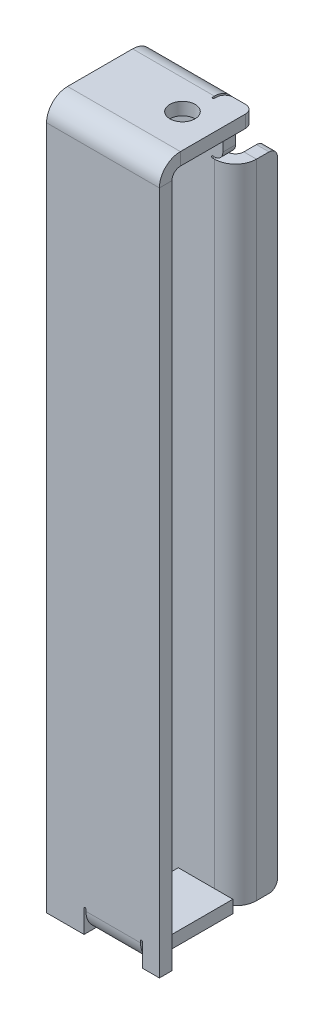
ISO-10303-21;
HEADER;
FILE_DESCRIPTION(('STEP AP214'),'2;1');
FILE_NAME('part.step','',(''),(''),'','','');
FILE_SCHEMA(('AUTOMOTIVE_DESIGN { 1 0 10303 214 1 1 1 1 }'));
ENDSEC;
DATA;
#1=APPLICATION_CONTEXT('core data for automotive mechanical design processes');
#2=APPLICATION_PROTOCOL_DEFINITION('international standard','automotive_design',2000,#1);
#3=PRODUCT_CONTEXT('',#1,'mechanical');
#4=PRODUCT('Part','Part','',(#3));
#5=PRODUCT_RELATED_PRODUCT_CATEGORY('part','',(#4));
#6=PRODUCT_DEFINITION_FORMATION('','',#4);
#7=PRODUCT_DEFINITION_CONTEXT('part definition',#1,'design');
#8=PRODUCT_DEFINITION('design','',#6,#7);
#9=PRODUCT_DEFINITION_SHAPE('','',#8);
#10=(LENGTH_UNIT() NAMED_UNIT(*) SI_UNIT(.MILLI.,.METRE.));
#11=(NAMED_UNIT(*) PLANE_ANGLE_UNIT() SI_UNIT($,.RADIAN.));
#12=(NAMED_UNIT(*) SI_UNIT($,.STERADIAN.) SOLID_ANGLE_UNIT());
#13=UNCERTAINTY_MEASURE_WITH_UNIT(LENGTH_MEASURE(1.E-05),#10,'distance_accuracy_value','');
#14=(GEOMETRIC_REPRESENTATION_CONTEXT(3) GLOBAL_UNCERTAINTY_ASSIGNED_CONTEXT((#13)) GLOBAL_UNIT_ASSIGNED_CONTEXT((#10,
#11,#12)) REPRESENTATION_CONTEXT('',''));
#15=CARTESIAN_POINT('',(0.,0.,0.));
#16=DIRECTION('',(0.,0.,1.));
#17=DIRECTION('',(1.,0.,0.));
#18=AXIS2_PLACEMENT_3D('',#15,#16,#17);
#19=CARTESIAN_POINT('',(0.,-2.99999999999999,3.));
#20=DIRECTION('',(0.,0.,-1.));
#21=DIRECTION('',(0.,1.,0.));
#22=AXIS2_PLACEMENT_3D('',#19,#20,#21);
#23=PLANE('',#22);
#24=DIRECTION('',(0.,-1.,0.));
#25=VECTOR('',#24,1.);
#26=CARTESIAN_POINT('',(8.92999999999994,-2.99999999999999,3.));
#27=LINE('',#26,#25);
#28=CARTESIAN_POINT('',(8.93,-162.55,3.00000000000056));
#29=VERTEX_POINT('',#28);
#30=CARTESIAN_POINT('',(8.93,-168.,3.00000000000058));
#31=VERTEX_POINT('',#30);
#32=EDGE_CURVE('E72',#29,#31,#27,.T.);
#33=ORIENTED_EDGE('',*,*,#32,.F.);
#34=CARTESIAN_POINT('',(9.155,-162.55,3.00000000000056));
#35=DIRECTION('',(0.,0.,-1.));
#36=DIRECTION('',(0.,1.,0.));
#37=AXIS2_PLACEMENT_3D('',#34,#35,#36);
#38=CIRCLE('',#37,0.225);
#39=CARTESIAN_POINT('',(9.38,-162.55,3.00000000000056));
#40=VERTEX_POINT('',#39);
#41=EDGE_CURVE('E76',#40,#29,#38,.F.);
#42=ORIENTED_EDGE('',*,*,#41,.F.);
#43=DIRECTION('',(0.,1.,0.));
#44=VECTOR('',#43,1.);
#45=CARTESIAN_POINT('',(9.38,-2.99999999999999,3.));
#46=LINE('',#45,#44);
#47=CARTESIAN_POINT('',(9.38,-163.,3.00000000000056));
#48=VERTEX_POINT('',#47);
#49=EDGE_CURVE('E495',#48,#40,#46,.T.);
#50=ORIENTED_EDGE('',*,*,#49,.F.);
#51=DIRECTION('',(-1.,0.,0.));
#52=VECTOR('',#51,1.);
#53=CARTESIAN_POINT('',(9.38,-163.,3.00000000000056));
#54=LINE('',#53,#52);
#55=CARTESIAN_POINT('',(22.38,-163.,3.00000000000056));
#56=VERTEX_POINT('',#55);
#57=EDGE_CURVE('E428',#48,#56,#54,.F.);
#58=ORIENTED_EDGE('',*,*,#57,.T.);
#59=DIRECTION('',(0.,-1.,0.));
#60=VECTOR('',#59,1.);
#61=CARTESIAN_POINT('',(22.38,-2.99999999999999,3.));
#62=LINE('',#61,#60);
#63=CARTESIAN_POINT('',(22.38,-162.55,3.00000000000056));
#64=VERTEX_POINT('',#63);
#65=EDGE_CURVE('E492',#64,#56,#62,.T.);
#66=ORIENTED_EDGE('',*,*,#65,.F.);
#67=CARTESIAN_POINT('',(22.605,-162.55,3.00000000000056));
#68=DIRECTION('',(0.,0.,-1.));
#69=DIRECTION('',(0.,1.,0.));
#70=AXIS2_PLACEMENT_3D('',#67,#68,#69);
#71=CIRCLE('',#70,0.225);
#72=CARTESIAN_POINT('',(22.83,-162.55,3.00000000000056));
#73=VERTEX_POINT('',#72);
#74=EDGE_CURVE('E489',#73,#64,#71,.F.);
#75=ORIENTED_EDGE('',*,*,#74,.F.);
#76=DIRECTION('',(0.,1.,0.));
#77=VECTOR('',#76,1.);
#78=CARTESIAN_POINT('',(22.83,-2.99999999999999,3.));
#79=LINE('',#78,#77);
#80=CARTESIAN_POINT('',(22.83,-168.,3.00000000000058));
#81=VERTEX_POINT('',#80);
#82=EDGE_CURVE('E454',#81,#73,#79,.T.);
#83=ORIENTED_EDGE('',*,*,#82,.F.);
#84=DIRECTION('',(1.,0.,0.));
#85=VECTOR('',#84,1.);
#86=CARTESIAN_POINT('',(26.88,-168.,3.00000000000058));
#87=LINE('',#86,#85);
#88=CARTESIAN_POINT('',(26.88,-168.,3.00000000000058));
#89=VERTEX_POINT('',#88);
#90=EDGE_CURVE('E511',#81,#89,#87,.T.);
#91=ORIENTED_EDGE('',*,*,#90,.T.);
#92=DIRECTION('',(0.,1.,0.));
#93=VECTOR('',#92,1.);
#94=CARTESIAN_POINT('',(26.88,-2.99999999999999,3.));
#95=LINE('',#94,#93);
#96=CARTESIAN_POINT('',(26.88,-4.99999999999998,3.00000000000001));
#97=VERTEX_POINT('',#96);
#98=EDGE_CURVE('E515',#89,#97,#95,.T.);
#99=ORIENTED_EDGE('',*,*,#98,.T.);
#100=DIRECTION('',(1.,0.,0.));
#101=VECTOR('',#100,1.);
#102=CARTESIAN_POINT('',(0.,-4.99999999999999,3.00000000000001));
#103=LINE('',#102,#101);
#104=CARTESIAN_POINT('',(0.,-4.99999999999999,3.00000000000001));
#105=VERTEX_POINT('',#104);
#106=EDGE_CURVE('E504',#105,#97,#103,.T.);
#107=ORIENTED_EDGE('',*,*,#106,.F.);
#108=DIRECTION('',(0.,-1.,0.));
#109=VECTOR('',#108,1.);
#110=CARTESIAN_POINT('',(0.,-168.,3.00000000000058));
#111=LINE('',#110,#109);
#112=CARTESIAN_POINT('',(0.,-168.,3.00000000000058));
#113=VERTEX_POINT('',#112);
#114=EDGE_CURVE('E509',#105,#113,#111,.T.);
#115=ORIENTED_EDGE('',*,*,#114,.T.);
#116=EDGE_CURVE('E513',#113,#31,#87,.T.);
#117=ORIENTED_EDGE('',*,*,#116,.T.);
#118=EDGE_LOOP('',(#33,#42,#50,#58,#66,#75,#83,#91,#99,#107,#115,#117));
#119=FACE_BOUND('',#118,.T.);
#120=ADVANCED_FACE('F57',(#119),#23,.F.);
#121=CARTESIAN_POINT('',(0.,-3.,0.));
#122=DIRECTION('',(0.,0.,-1.));
#123=DIRECTION('',(0.,1.,0.));
#124=AXIS2_PLACEMENT_3D('',#121,#122,#123);
#125=PLANE('',#124);
#126=CARTESIAN_POINT('',(9.155,-162.55,5.56142430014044E-13));
#127=DIRECTION('',(0.,0.,-1.));
#128=DIRECTION('',(0.,1.,0.));
#129=AXIS2_PLACEMENT_3D('',#126,#127,#128);
#130=CIRCLE('',#129,0.225);
#131=CARTESIAN_POINT('',(8.93,-162.55,5.57066170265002E-13));
#132=VERTEX_POINT('',#131);
#133=CARTESIAN_POINT('',(9.38,-162.55,5.57066170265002E-13));
#134=VERTEX_POINT('',#133);
#135=EDGE_CURVE('E456',#132,#134,#130,.T.);
#136=ORIENTED_EDGE('',*,*,#135,.F.);
#137=DIRECTION('',(0.,1.,0.));
#138=VECTOR('',#137,1.);
#139=CARTESIAN_POINT('',(8.93,-168.,5.75632884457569E-13));
#140=LINE('',#139,#138);
#141=CARTESIAN_POINT('',(8.93,-168.,5.76094754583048E-13));
#142=VERTEX_POINT('',#141);
#143=EDGE_CURVE('E451',#142,#132,#140,.T.);
#144=ORIENTED_EDGE('',*,*,#143,.F.);
#145=DIRECTION('',(1.,0.,0.));
#146=VECTOR('',#145,1.);
#147=CARTESIAN_POINT('',(26.88,-168.,5.76094754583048E-13));
#148=LINE('',#147,#146);
#149=CARTESIAN_POINT('',(0.,-168.,5.76094754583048E-13));
#150=VERTEX_POINT('',#149);
#151=EDGE_CURVE('E521',#150,#142,#148,.T.);
#152=ORIENTED_EDGE('',*,*,#151,.F.);
#153=DIRECTION('',(0.,-1.,0.));
#154=VECTOR('',#153,1.);
#155=CARTESIAN_POINT('',(0.,-168.,5.76094754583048E-13));
#156=LINE('',#155,#154);
#157=CARTESIAN_POINT('',(0.,-4.99999999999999,0.));
#158=VERTEX_POINT('',#157);
#159=EDGE_CURVE('E508',#158,#150,#156,.T.);
#160=ORIENTED_EDGE('',*,*,#159,.F.);
#161=DIRECTION('',(-1.,0.,0.));
#162=VECTOR('',#161,1.);
#163=CARTESIAN_POINT('',(26.88,-4.99999999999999,0.));
#164=LINE('',#163,#162);
#165=CARTESIAN_POINT('',(26.88,-4.99999999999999,0.));
#166=VERTEX_POINT('',#165);
#167=EDGE_CURVE('E499',#166,#158,#164,.T.);
#168=ORIENTED_EDGE('',*,*,#167,.F.);
#169=DIRECTION('',(0.,1.,0.));
#170=VECTOR('',#169,1.);
#171=CARTESIAN_POINT('',(26.88,-3.,0.));
#172=LINE('',#171,#170);
#173=CARTESIAN_POINT('',(26.88,-168.,5.76094754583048E-13));
#174=VERTEX_POINT('',#173);
#175=EDGE_CURVE('E512',#174,#166,#172,.T.);
#176=ORIENTED_EDGE('',*,*,#175,.F.);
#177=CARTESIAN_POINT('',(22.83,-168.,5.76094754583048E-13));
#178=VERTEX_POINT('',#177);
#179=EDGE_CURVE('E520',#178,#174,#148,.T.);
#180=ORIENTED_EDGE('',*,*,#179,.F.);
#181=DIRECTION('',(0.,-1.,0.));
#182=VECTOR('',#181,1.);
#183=CARTESIAN_POINT('',(22.83,-162.55,5.56142430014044E-13));
#184=LINE('',#183,#182);
#185=CARTESIAN_POINT('',(22.83,-162.55,5.57066170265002E-13));
#186=VERTEX_POINT('',#185);
#187=EDGE_CURVE('E471',#186,#178,#184,.T.);
#188=ORIENTED_EDGE('',*,*,#187,.F.);
#189=CARTESIAN_POINT('',(22.605,-162.55,5.56142430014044E-13));
#190=DIRECTION('',(0.,0.,-1.));
#191=DIRECTION('',(0.,1.,0.));
#192=AXIS2_PLACEMENT_3D('',#189,#190,#191);
#193=CIRCLE('',#192,0.225);
#194=CARTESIAN_POINT('',(22.38,-162.55,5.57066170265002E-13));
#195=VERTEX_POINT('',#194);
#196=EDGE_CURVE('E467',#195,#186,#193,.T.);
#197=ORIENTED_EDGE('',*,*,#196,.F.);
#198=DIRECTION('',(0.,1.,0.));
#199=VECTOR('',#198,1.);
#200=CARTESIAN_POINT('',(22.38,-163.,5.57713597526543E-13));
#201=LINE('',#200,#199);
#202=CARTESIAN_POINT('',(22.38,-163.,5.58637337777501E-13));
#203=VERTEX_POINT('',#202);
#204=EDGE_CURVE('E464',#203,#195,#201,.T.);
#205=ORIENTED_EDGE('',*,*,#204,.F.);
#206=DIRECTION('',(-1.,0.,0.));
#207=VECTOR('',#206,1.);
#208=CARTESIAN_POINT('',(9.38,-163.,5.57713597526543E-13));
#209=LINE('',#208,#207);
#210=CARTESIAN_POINT('',(9.38,-163.,5.58637337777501E-13));
#211=VERTEX_POINT('',#210);
#212=EDGE_CURVE('E440',#211,#203,#209,.F.);
#213=ORIENTED_EDGE('',*,*,#212,.F.);
#214=DIRECTION('',(0.,-1.,0.));
#215=VECTOR('',#214,1.);
#216=CARTESIAN_POINT('',(9.38,-162.55,5.56142430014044E-13));
#217=LINE('',#216,#215);
#218=EDGE_CURVE('E460',#134,#211,#217,.T.);
#219=ORIENTED_EDGE('',*,*,#218,.F.);
#220=EDGE_LOOP('',(#136,#144,#152,#160,#168,#176,#180,#188,#197,#205,#213,#219));
#221=FACE_BOUND('',#220,.T.);
#222=ADVANCED_FACE('F993',(#221),#125,.T.);
#223=CARTESIAN_POINT('',(26.88,-168.,3.00000000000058));
#224=DIRECTION('',(0.,1.,0.));
#225=DIRECTION('',(0.,0.,1.));
#226=AXIS2_PLACEMENT_3D('',#223,#224,#225);
#227=PLANE('',#226);
#228=DIRECTION('',(0.,0.,1.));
#229=VECTOR('',#228,1.);
#230=CARTESIAN_POINT('',(8.93,-168.,5.75632884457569E-13));
#231=LINE('',#230,#229);
#232=EDGE_CURVE('E455',#142,#31,#231,.T.);
#233=ORIENTED_EDGE('',*,*,#232,.T.);
#234=ORIENTED_EDGE('',*,*,#116,.F.);
#235=DIRECTION('',(0.,0.,-1.));
#236=VECTOR('',#235,1.);
#237=CARTESIAN_POINT('',(0.,-168.,3.00000000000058));
#238=LINE('',#237,#236);
#239=EDGE_CURVE('E528',#113,#150,#238,.T.);
#240=ORIENTED_EDGE('',*,*,#239,.T.);
#241=ORIENTED_EDGE('',*,*,#151,.T.);
#242=EDGE_LOOP('',(#233,#234,#240,#241));
#243=FACE_BOUND('',#242,.T.);
#244=ADVANCED_FACE('F1004',(#243),#227,.F.);
#245=DIRECTION('',(0.,0.,1.));
#246=VECTOR('',#245,1.);
#247=CARTESIAN_POINT('',(22.83,-168.,5.75632884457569E-13));
#248=LINE('',#247,#246);
#249=EDGE_CURVE('E474',#178,#81,#248,.T.);
#250=ORIENTED_EDGE('',*,*,#249,.F.);
#251=ORIENTED_EDGE('',*,*,#179,.T.);
#252=DIRECTION('',(0.,0.,-1.));
#253=VECTOR('',#252,1.);
#254=CARTESIAN_POINT('',(26.88,-168.,3.00000000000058));
#255=LINE('',#254,#253);
#256=EDGE_CURVE('E518',#89,#174,#255,.T.);
#257=ORIENTED_EDGE('',*,*,#256,.F.);
#258=ORIENTED_EDGE('',*,*,#90,.F.);
#259=EDGE_LOOP('',(#250,#251,#257,#258));
#260=FACE_BOUND('',#259,.T.);
#261=ADVANCED_FACE('F990',(#260),#227,.F.);
#262=CARTESIAN_POINT('',(0.,-3.,-19.5));
#263=DIRECTION('',(0.,-1.,0.));
#264=DIRECTION('',(0.,0.,-1.));
#265=AXIS2_PLACEMENT_3D('',#262,#263,#264);
#266=PLANE('',#265);
#267=CARTESIAN_POINT('',(18.88,-3.,-10.5));
#268=DIRECTION('',(0.,-1.,0.));
#269=DIRECTION('',(0.,0.,-1.));
#270=AXIS2_PLACEMENT_3D('',#267,#268,#269);
#271=CIRCLE('',#270,3.);
#272=CARTESIAN_POINT('',(18.88,-3.,-13.5));
#273=VERTEX_POINT('',#272);
#274=EDGE_CURVE('E675',#273,#273,#271,.F.);
#275=ORIENTED_EDGE('',*,*,#274,.T.);
#276=EDGE_LOOP('',(#275));
#277=FACE_BOUND('',#276,.T.);
#278=DIRECTION('',(0.,0.,-1.));
#279=VECTOR('',#278,1.);
#280=CARTESIAN_POINT('',(26.88,-3.,0.));
#281=LINE('',#280,#279);
#282=CARTESIAN_POINT('',(26.88,-3.,-1.99999999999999));
#283=VERTEX_POINT('',#282);
#284=CARTESIAN_POINT('',(26.88,-3.,-17.5));
#285=VERTEX_POINT('',#284);
#286=EDGE_CURVE('E759',#283,#285,#281,.T.);
#287=ORIENTED_EDGE('',*,*,#286,.F.);
#288=DIRECTION('',(-1.,0.,0.));
#289=VECTOR('',#288,1.);
#290=CARTESIAN_POINT('',(0.,-2.99999999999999,-1.99999999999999));
#291=LINE('',#290,#289);
#292=CARTESIAN_POINT('',(0.,-3.,-1.99999999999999));
#293=VERTEX_POINT('',#292);
#294=EDGE_CURVE('E545',#293,#283,#291,.F.);
#295=ORIENTED_EDGE('',*,*,#294,.F.);
#296=DIRECTION('',(0.,0.,1.));
#297=VECTOR('',#296,1.);
#298=CARTESIAN_POINT('',(0.,-3.,0.));
#299=LINE('',#298,#297);
#300=CARTESIAN_POINT('',(0.,-3.,-17.5));
#301=VERTEX_POINT('',#300);
#302=EDGE_CURVE('E756',#301,#293,#299,.T.);
#303=ORIENTED_EDGE('',*,*,#302,.F.);
#304=DIRECTION('',(1.,0.,0.));
#305=VECTOR('',#304,1.);
#306=CARTESIAN_POINT('',(19.5,-3.00000000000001,-17.5));
#307=LINE('',#306,#305);
#308=CARTESIAN_POINT('',(19.5,-3.,-17.5));
#309=VERTEX_POINT('',#308);
#310=EDGE_CURVE('E732',#309,#301,#307,.F.);
#311=ORIENTED_EDGE('',*,*,#310,.F.);
#312=DIRECTION('',(0.,0.,-1.));
#313=VECTOR('',#312,1.);
#314=CARTESIAN_POINT('',(19.5,-3.00000000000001,-17.05));
#315=LINE('',#314,#313);
#316=CARTESIAN_POINT('',(19.5,-3.,-17.05));
#317=VERTEX_POINT('',#316);
#318=EDGE_CURVE('E749',#317,#309,#315,.T.);
#319=ORIENTED_EDGE('',*,*,#318,.F.);
#320=CARTESIAN_POINT('',(19.725,-3.00000000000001,-17.05));
#321=DIRECTION('',(0.,-1.,0.));
#322=DIRECTION('',(0.,0.,-1.));
#323=AXIS2_PLACEMENT_3D('',#320,#321,#322);
#324=CIRCLE('',#323,0.225);
#325=CARTESIAN_POINT('',(19.95,-3.,-17.05));
#326=VERTEX_POINT('',#325);
#327=EDGE_CURVE('E745',#326,#317,#324,.T.);
#328=ORIENTED_EDGE('',*,*,#327,.F.);
#329=DIRECTION('',(0.,0.,1.));
#330=VECTOR('',#329,1.);
#331=CARTESIAN_POINT('',(19.95,-3.,-19.5));
#332=LINE('',#331,#330);
#333=CARTESIAN_POINT('',(19.95,-3.00000000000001,-17.5));
#334=VERTEX_POINT('',#333);
#335=EDGE_CURVE('E742',#334,#326,#332,.T.);
#336=ORIENTED_EDGE('',*,*,#335,.F.);
#337=CARTESIAN_POINT('',(21.95,-3.,-17.5));
#338=DIRECTION('',(0.,-1.,0.));
#339=DIRECTION('',(0.,0.,-1.));
#340=AXIS2_PLACEMENT_3D('',#337,#338,#339);
#341=CIRCLE('',#340,2.);
#342=CARTESIAN_POINT('',(21.95,-3.,-19.5));
#343=VERTEX_POINT('',#342);
#344=EDGE_CURVE('E65',#334,#343,#341,.T.);
#345=ORIENTED_EDGE('',*,*,#344,.T.);
#346=DIRECTION('',(-1.,0.,0.));
#347=VECTOR('',#346,1.);
#348=CARTESIAN_POINT('',(0.,-3.,-19.5));
#349=LINE('',#348,#347);
#350=CARTESIAN_POINT('',(24.88,-3.,-19.5));
#351=VERTEX_POINT('',#350);
#352=EDGE_CURVE('E762',#351,#343,#349,.T.);
#353=ORIENTED_EDGE('',*,*,#352,.F.);
#354=CARTESIAN_POINT('',(24.88,-3.,-17.5));
#355=DIRECTION('',(0.,-1.,0.));
#356=DIRECTION('',(0.,0.,-1.));
#357=AXIS2_PLACEMENT_3D('',#354,#355,#356);
#358=CIRCLE('',#357,2.);
#359=EDGE_CURVE('E856',#351,#285,#358,.T.);
#360=ORIENTED_EDGE('',*,*,#359,.T.);
#361=EDGE_LOOP('',(#287,#295,#303,#311,#319,#328,#336,#345,#353,#360));
#362=FACE_BOUND('',#361,.T.);
#363=ADVANCED_FACE('F863',(#277,#362),#266,.T.);
#364=CARTESIAN_POINT('',(0.,0.,-19.5));
#365=DIRECTION('',(0.,-1.,0.));
#366=DIRECTION('',(0.,0.,-1.));
#367=AXIS2_PLACEMENT_3D('',#364,#365,#366);
#368=PLANE('',#367);
#369=CARTESIAN_POINT('',(18.88,0.,-10.5));
#370=DIRECTION('',(0.,1.,0.));
#371=DIRECTION('',(0.,0.,1.));
#372=AXIS2_PLACEMENT_3D('',#369,#370,#371);
#373=CIRCLE('',#372,3.);
#374=CARTESIAN_POINT('',(18.88,0.,-7.49999999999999));
#375=VERTEX_POINT('',#374);
#376=EDGE_CURVE('E687',#375,#375,#373,.T.);
#377=ORIENTED_EDGE('',*,*,#376,.F.);
#378=EDGE_LOOP('',(#377));
#379=FACE_BOUND('',#378,.T.);
#380=DIRECTION('',(-1.,0.,0.));
#381=VECTOR('',#380,1.);
#382=CARTESIAN_POINT('',(0.,0.,-1.99999999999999));
#383=LINE('',#382,#381);
#384=CARTESIAN_POINT('',(0.,0.,-1.99999999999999));
#385=VERTEX_POINT('',#384);
#386=CARTESIAN_POINT('',(26.88,0.,-1.99999999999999));
#387=VERTEX_POINT('',#386);
#388=EDGE_CURVE('E532',#385,#387,#383,.F.);
#389=ORIENTED_EDGE('',*,*,#388,.T.);
#390=DIRECTION('',(0.,0.,-1.));
#391=VECTOR('',#390,1.);
#392=CARTESIAN_POINT('',(26.88,0.,0.));
#393=LINE('',#392,#391);
#394=CARTESIAN_POINT('',(26.88,0.,-17.5));
#395=VERTEX_POINT('',#394);
#396=EDGE_CURVE('E767',#387,#395,#393,.T.);
#397=ORIENTED_EDGE('',*,*,#396,.T.);
#398=CARTESIAN_POINT('',(24.88,0.,-17.5));
#399=DIRECTION('',(0.,-1.,0.));
#400=DIRECTION('',(0.,0.,-1.));
#401=AXIS2_PLACEMENT_3D('',#398,#399,#400);
#402=CIRCLE('',#401,2.);
#403=CARTESIAN_POINT('',(24.88,0.,-19.5));
#404=VERTEX_POINT('',#403);
#405=EDGE_CURVE('E850',#395,#404,#402,.F.);
#406=ORIENTED_EDGE('',*,*,#405,.T.);
#407=DIRECTION('',(-1.,0.,0.));
#408=VECTOR('',#407,1.);
#409=CARTESIAN_POINT('',(0.,0.,-19.5));
#410=LINE('',#409,#408);
#411=CARTESIAN_POINT('',(21.95,0.,-19.5));
#412=VERTEX_POINT('',#411);
#413=EDGE_CURVE('E760',#404,#412,#410,.T.);
#414=ORIENTED_EDGE('',*,*,#413,.T.);
#415=CARTESIAN_POINT('',(21.95,0.,-17.5));
#416=DIRECTION('',(0.,-1.,0.));
#417=DIRECTION('',(0.,0.,-1.));
#418=AXIS2_PLACEMENT_3D('',#415,#416,#417);
#419=CIRCLE('',#418,2.);
#420=CARTESIAN_POINT('',(19.95,0.,-17.5));
#421=VERTEX_POINT('',#420);
#422=EDGE_CURVE('E852',#412,#421,#419,.F.);
#423=ORIENTED_EDGE('',*,*,#422,.T.);
#424=DIRECTION('',(0.,0.,-1.));
#425=VECTOR('',#424,1.);
#426=CARTESIAN_POINT('',(19.95,0.,-19.5));
#427=LINE('',#426,#425);
#428=CARTESIAN_POINT('',(19.95,0.,-17.05));
#429=VERTEX_POINT('',#428);
#430=EDGE_CURVE('E776',#429,#421,#427,.T.);
#431=ORIENTED_EDGE('',*,*,#430,.F.);
#432=CARTESIAN_POINT('',(19.725,0.,-17.05));
#433=DIRECTION('',(0.,-1.,0.));
#434=DIRECTION('',(0.,0.,-1.));
#435=AXIS2_PLACEMENT_3D('',#432,#433,#434);
#436=CIRCLE('',#435,0.225);
#437=CARTESIAN_POINT('',(19.5,0.,-17.05));
#438=VERTEX_POINT('',#437);
#439=EDGE_CURVE('E773',#438,#429,#436,.F.);
#440=ORIENTED_EDGE('',*,*,#439,.F.);
#441=DIRECTION('',(0.,0.,1.));
#442=VECTOR('',#441,1.);
#443=CARTESIAN_POINT('',(19.5,0.,-19.5));
#444=LINE('',#443,#442);
#445=CARTESIAN_POINT('',(19.5,0.,-17.5));
#446=VERTEX_POINT('',#445);
#447=EDGE_CURVE('E765',#446,#438,#444,.T.);
#448=ORIENTED_EDGE('',*,*,#447,.F.);
#449=DIRECTION('',(1.,0.,0.));
#450=VECTOR('',#449,1.);
#451=CARTESIAN_POINT('',(19.5,0.,-17.5));
#452=LINE('',#451,#450);
#453=CARTESIAN_POINT('',(0.,0.,-17.5));
#454=VERTEX_POINT('',#453);
#455=EDGE_CURVE('E720',#446,#454,#452,.F.);
#456=ORIENTED_EDGE('',*,*,#455,.T.);
#457=DIRECTION('',(0.,0.,1.));
#458=VECTOR('',#457,1.);
#459=CARTESIAN_POINT('',(0.,0.,0.));
#460=LINE('',#459,#458);
#461=EDGE_CURVE('E744',#454,#385,#460,.T.);
#462=ORIENTED_EDGE('',*,*,#461,.T.);
#463=EDGE_LOOP('',(#389,#397,#406,#414,#423,#431,#440,#448,#456,#462));
#464=FACE_BOUND('',#463,.T.);
#465=ADVANCED_FACE('F875',(#379,#464),#368,.F.);
#466=CARTESIAN_POINT('',(0.,-3.,0.));
#467=DIRECTION('',(-1.,0.,0.));
#468=DIRECTION('',(0.,0.,1.));
#469=AXIS2_PLACEMENT_3D('',#466,#467,#468);
#470=PLANE('',#469);
#471=ORIENTED_EDGE('',*,*,#302,.T.);
#472=DIRECTION('',(0.,1.,0.));
#473=VECTOR('',#472,1.);
#474=CARTESIAN_POINT('',(0.,-2.99999999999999,-1.99999999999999));
#475=LINE('',#474,#473);
#476=EDGE_CURVE('E539',#293,#385,#475,.T.);
#477=ORIENTED_EDGE('',*,*,#476,.T.);
#478=ORIENTED_EDGE('',*,*,#461,.F.);
#479=DIRECTION('',(0.,1.,0.));
#480=VECTOR('',#479,1.);
#481=CARTESIAN_POINT('',(0.,-3.00000000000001,-17.5));
#482=LINE('',#481,#480);
#483=EDGE_CURVE('E737',#301,#454,#482,.T.);
#484=ORIENTED_EDGE('',*,*,#483,.F.);
#485=EDGE_LOOP('',(#471,#477,#478,#484));
#486=FACE_BOUND('',#485,.T.);
#487=ADVANCED_FACE('F971',(#486),#470,.T.);
#488=CARTESIAN_POINT('',(19.5,-2.99999999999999,-22.5));
#489=DIRECTION('',(0.,0.,1.));
#490=DIRECTION('',(0.,-1.,0.));
#491=AXIS2_PLACEMENT_3D('',#488,#489,#490);
#492=PLANE('',#491);
#493=DIRECTION('',(0.,-1.,0.));
#494=VECTOR('',#493,1.);
#495=CARTESIAN_POINT('',(19.5,-168.,-22.5000000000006));
#496=LINE('',#495,#494);
#497=CARTESIAN_POINT('',(19.5,-4.99999999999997,-22.5));
#498=VERTEX_POINT('',#497);
#499=CARTESIAN_POINT('',(19.5,-12.5499999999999,-22.5));
#500=VERTEX_POINT('',#499);
#501=EDGE_CURVE('E704',#498,#500,#496,.T.);
#502=ORIENTED_EDGE('',*,*,#501,.T.);
#503=CARTESIAN_POINT('',(17.5,-12.5499999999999,-22.5));
#504=DIRECTION('',(0.,0.,1.));
#505=DIRECTION('',(0.,-1.,0.));
#506=AXIS2_PLACEMENT_3D('',#503,#504,#505);
#507=CIRCLE('',#506,2.);
#508=CARTESIAN_POINT('',(17.5,-14.5499999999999,-22.5));
#509=VERTEX_POINT('',#508);
#510=EDGE_CURVE('E802',#500,#509,#507,.F.);
#511=ORIENTED_EDGE('',*,*,#510,.T.);
#512=DIRECTION('',(1.,0.,0.));
#513=VECTOR('',#512,1.);
#514=CARTESIAN_POINT('',(17.05,-14.5499999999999,-22.5));
#515=LINE('',#514,#513);
#516=CARTESIAN_POINT('',(17.05,-14.5499999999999,-22.5));
#517=VERTEX_POINT('',#516);
#518=EDGE_CURVE('E680',#517,#509,#515,.T.);
#519=ORIENTED_EDGE('',*,*,#518,.F.);
#520=CARTESIAN_POINT('',(17.05,-14.7749999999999,-22.5));
#521=DIRECTION('',(0.,0.,-1.));
#522=DIRECTION('',(0.,1.,0.));
#523=AXIS2_PLACEMENT_3D('',#520,#521,#522);
#524=CIRCLE('',#523,0.225);
#525=CARTESIAN_POINT('',(17.05,-14.9999999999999,-22.5));
#526=VERTEX_POINT('',#525);
#527=EDGE_CURVE('E676',#526,#517,#524,.T.);
#528=ORIENTED_EDGE('',*,*,#527,.F.);
#529=DIRECTION('',(-1.,0.,0.));
#530=VECTOR('',#529,1.);
#531=CARTESIAN_POINT('',(17.5,-14.9999999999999,-22.5));
#532=LINE('',#531,#530);
#533=CARTESIAN_POINT('',(17.5,-14.9999999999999,-22.5));
#534=VERTEX_POINT('',#533);
#535=EDGE_CURVE('E672',#534,#526,#532,.T.);
#536=ORIENTED_EDGE('',*,*,#535,.F.);
#537=DIRECTION('',(0.,-1.,0.));
#538=VECTOR('',#537,1.);
#539=CARTESIAN_POINT('',(17.5,-168.,-22.5000000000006));
#540=LINE('',#539,#538);
#541=CARTESIAN_POINT('',(17.5,-168.,-22.5000000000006));
#542=VERTEX_POINT('',#541);
#543=EDGE_CURVE('E646',#542,#534,#540,.F.);
#544=ORIENTED_EDGE('',*,*,#543,.F.);
#545=DIRECTION('',(-1.,0.,0.));
#546=VECTOR('',#545,1.);
#547=CARTESIAN_POINT('',(0.,-168.,-22.5000000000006));
#548=LINE('',#547,#546);
#549=CARTESIAN_POINT('',(2.,-168.,-22.5000000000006));
#550=VERTEX_POINT('',#549);
#551=EDGE_CURVE('E707',#542,#550,#548,.T.);
#552=ORIENTED_EDGE('',*,*,#551,.T.);
#553=DIRECTION('',(0.,1.,0.));
#554=VECTOR('',#553,1.);
#555=CARTESIAN_POINT('',(2.,-14.9999999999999,-22.5));
#556=LINE('',#555,#554);
#557=CARTESIAN_POINT('',(2.,-14.9999999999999,-22.5));
#558=VERTEX_POINT('',#557);
#559=EDGE_CURVE('E596',#558,#550,#556,.F.);
#560=ORIENTED_EDGE('',*,*,#559,.F.);
#561=DIRECTION('',(-1.,0.,0.));
#562=VECTOR('',#561,1.);
#563=CARTESIAN_POINT('',(2.45,-14.9999999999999,-22.5));
#564=LINE('',#563,#562);
#565=CARTESIAN_POINT('',(2.45,-14.9999999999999,-22.5));
#566=VERTEX_POINT('',#565);
#567=EDGE_CURVE('E663',#566,#558,#564,.T.);
#568=ORIENTED_EDGE('',*,*,#567,.F.);
#569=CARTESIAN_POINT('',(2.45,-14.7749999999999,-22.5));
#570=DIRECTION('',(0.,0.,-1.));
#571=DIRECTION('',(0.,1.,0.));
#572=AXIS2_PLACEMENT_3D('',#569,#570,#571);
#573=CIRCLE('',#572,0.225);
#574=CARTESIAN_POINT('',(2.45,-14.5499999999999,-22.5));
#575=VERTEX_POINT('',#574);
#576=EDGE_CURVE('E659',#575,#566,#573,.T.);
#577=ORIENTED_EDGE('',*,*,#576,.F.);
#578=DIRECTION('',(1.,0.,0.));
#579=VECTOR('',#578,1.);
#580=CARTESIAN_POINT('',(0.,-14.5499999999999,-22.5));
#581=LINE('',#580,#579);
#582=CARTESIAN_POINT('',(2.,-14.5499999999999,-22.5));
#583=VERTEX_POINT('',#582);
#584=EDGE_CURVE('E656',#583,#575,#581,.T.);
#585=ORIENTED_EDGE('',*,*,#584,.F.);
#586=CARTESIAN_POINT('',(2.,-12.5499999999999,-22.5));
#587=DIRECTION('',(0.,0.,1.));
#588=DIRECTION('',(0.,-1.,0.));
#589=AXIS2_PLACEMENT_3D('',#586,#587,#588);
#590=CIRCLE('',#589,2.);
#591=CARTESIAN_POINT('',(0.,-12.5499999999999,-22.5));
#592=VERTEX_POINT('',#591);
#593=EDGE_CURVE('E800',#583,#592,#590,.F.);
#594=ORIENTED_EDGE('',*,*,#593,.T.);
#595=DIRECTION('',(0.,1.,0.));
#596=VECTOR('',#595,1.);
#597=CARTESIAN_POINT('',(0.,-2.99999999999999,-22.5));
#598=LINE('',#597,#596);
#599=CARTESIAN_POINT('',(0.,-4.99999999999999,-22.5));
#600=VERTEX_POINT('',#599);
#601=EDGE_CURVE('E711',#592,#600,#598,.T.);
#602=ORIENTED_EDGE('',*,*,#601,.T.);
#603=DIRECTION('',(-1.,0.,0.));
#604=VECTOR('',#603,1.);
#605=CARTESIAN_POINT('',(19.5,-4.99999999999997,-22.5));
#606=LINE('',#605,#604);
#607=EDGE_CURVE('E698',#498,#600,#606,.T.);
#608=ORIENTED_EDGE('',*,*,#607,.F.);
#609=EDGE_LOOP('',(#502,#511,#519,#528,#536,#544,#552,#560,#568,#577,#585,#594,#602,#608));
#610=FACE_BOUND('',#609,.T.);
#611=ADVANCED_FACE('F908',(#610),#492,.F.);
#612=CARTESIAN_POINT('',(19.5,-3.,-19.5));
#613=DIRECTION('',(0.,0.,1.));
#614=DIRECTION('',(0.,-1.,0.));
#615=AXIS2_PLACEMENT_3D('',#612,#613,#614);
#616=PLANE('',#615);
#617=DIRECTION('',(1.,0.,0.));
#618=VECTOR('',#617,1.);
#619=CARTESIAN_POINT('',(19.5,-14.5499999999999,-19.5));
#620=LINE('',#619,#618);
#621=CARTESIAN_POINT('',(17.05,-14.5499999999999,-19.5));
#622=VERTEX_POINT('',#621);
#623=CARTESIAN_POINT('',(17.5,-14.5499999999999,-19.5));
#624=VERTEX_POINT('',#623);
#625=EDGE_CURVE('E779',#622,#624,#620,.T.);
#626=ORIENTED_EDGE('',*,*,#625,.T.);
#627=CARTESIAN_POINT('',(17.5,-12.5499999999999,-19.5));
#628=DIRECTION('',(0.,0.,1.));
#629=DIRECTION('',(0.,-1.,0.));
#630=AXIS2_PLACEMENT_3D('',#627,#628,#629);
#631=CIRCLE('',#630,2.);
#632=CARTESIAN_POINT('',(19.5,-12.5499999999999,-19.5));
#633=VERTEX_POINT('',#632);
#634=EDGE_CURVE('E796',#624,#633,#631,.T.);
#635=ORIENTED_EDGE('',*,*,#634,.T.);
#636=DIRECTION('',(0.,-1.,0.));
#637=VECTOR('',#636,1.);
#638=CARTESIAN_POINT('',(19.5,-168.,-19.5000000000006));
#639=LINE('',#638,#637);
#640=CARTESIAN_POINT('',(19.5,-5.,-19.5));
#641=VERTEX_POINT('',#640);
#642=EDGE_CURVE('E703',#641,#633,#639,.T.);
#643=ORIENTED_EDGE('',*,*,#642,.F.);
#644=DIRECTION('',(1.,0.,0.));
#645=VECTOR('',#644,1.);
#646=CARTESIAN_POINT('',(0.,-4.99999999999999,-19.5));
#647=LINE('',#646,#645);
#648=CARTESIAN_POINT('',(0.,-5.,-19.5));
#649=VERTEX_POINT('',#648);
#650=EDGE_CURVE('E693',#649,#641,#647,.T.);
#651=ORIENTED_EDGE('',*,*,#650,.F.);
#652=DIRECTION('',(0.,1.,0.));
#653=VECTOR('',#652,1.);
#654=CARTESIAN_POINT('',(0.,-3.,-19.5));
#655=LINE('',#654,#653);
#656=CARTESIAN_POINT('',(0.,-12.5499999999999,-19.5));
#657=VERTEX_POINT('',#656);
#658=EDGE_CURVE('E708',#657,#649,#655,.T.);
#659=ORIENTED_EDGE('',*,*,#658,.F.);
#660=CARTESIAN_POINT('',(2.,-12.5499999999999,-19.5));
#661=DIRECTION('',(0.,0.,1.));
#662=DIRECTION('',(0.,-1.,0.));
#663=AXIS2_PLACEMENT_3D('',#660,#661,#662);
#664=CIRCLE('',#663,2.);
#665=CARTESIAN_POINT('',(2.,-14.5499999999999,-19.5));
#666=VERTEX_POINT('',#665);
#667=EDGE_CURVE('E794',#657,#666,#664,.T.);
#668=ORIENTED_EDGE('',*,*,#667,.T.);
#669=DIRECTION('',(1.,0.,0.));
#670=VECTOR('',#669,1.);
#671=CARTESIAN_POINT('',(19.5,-14.5499999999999,-19.5));
#672=LINE('',#671,#670);
#673=CARTESIAN_POINT('',(2.45,-14.5499999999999,-19.5));
#674=VERTEX_POINT('',#673);
#675=EDGE_CURVE('E658',#666,#674,#672,.T.);
#676=ORIENTED_EDGE('',*,*,#675,.T.);
#677=CARTESIAN_POINT('',(2.45,-14.7749999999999,-19.5));
#678=DIRECTION('',(0.,0.,1.));
#679=DIRECTION('',(0.,-1.,0.));
#680=AXIS2_PLACEMENT_3D('',#677,#678,#679);
#681=CIRCLE('',#680,0.225);
#682=CARTESIAN_POINT('',(2.45,-14.9999999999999,-19.5));
#683=VERTEX_POINT('',#682);
#684=EDGE_CURVE('E789',#674,#683,#681,.F.);
#685=ORIENTED_EDGE('',*,*,#684,.T.);
#686=DIRECTION('',(-1.,0.,0.));
#687=VECTOR('',#686,1.);
#688=CARTESIAN_POINT('',(19.5,-14.9999999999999,-19.5));
#689=LINE('',#688,#687);
#690=CARTESIAN_POINT('',(2.,-14.9999999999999,-19.5));
#691=VERTEX_POINT('',#690);
#692=EDGE_CURVE('E786',#683,#691,#689,.T.);
#693=ORIENTED_EDGE('',*,*,#692,.T.);
#694=DIRECTION('',(0.,1.,0.));
#695=VECTOR('',#694,1.);
#696=CARTESIAN_POINT('',(2.,-14.9999999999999,-19.5));
#697=LINE('',#696,#695);
#698=CARTESIAN_POINT('',(2.,-168.,-19.5000000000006));
#699=VERTEX_POINT('',#698);
#700=EDGE_CURVE('E583',#691,#699,#697,.F.);
#701=ORIENTED_EDGE('',*,*,#700,.T.);
#702=DIRECTION('',(-1.,0.,0.));
#703=VECTOR('',#702,1.);
#704=CARTESIAN_POINT('',(0.,-168.,-19.5000000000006));
#705=LINE('',#704,#703);
#706=CARTESIAN_POINT('',(17.5,-168.,-19.5000000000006));
#707=VERTEX_POINT('',#706);
#708=EDGE_CURVE('E716',#707,#699,#705,.T.);
#709=ORIENTED_EDGE('',*,*,#708,.F.);
#710=DIRECTION('',(0.,-1.,0.));
#711=VECTOR('',#710,1.);
#712=CARTESIAN_POINT('',(17.5,-168.,-19.5000000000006));
#713=LINE('',#712,#711);
#714=CARTESIAN_POINT('',(17.5,-14.9999999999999,-19.5));
#715=VERTEX_POINT('',#714);
#716=EDGE_CURVE('E633',#707,#715,#713,.F.);
#717=ORIENTED_EDGE('',*,*,#716,.T.);
#718=DIRECTION('',(-1.,0.,0.));
#719=VECTOR('',#718,1.);
#720=CARTESIAN_POINT('',(19.5,-14.9999999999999,-19.5));
#721=LINE('',#720,#719);
#722=CARTESIAN_POINT('',(17.05,-14.9999999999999,-19.5));
#723=VERTEX_POINT('',#722);
#724=EDGE_CURVE('E784',#715,#723,#721,.T.);
#725=ORIENTED_EDGE('',*,*,#724,.T.);
#726=CARTESIAN_POINT('',(17.05,-14.7749999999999,-19.5));
#727=DIRECTION('',(0.,0.,1.));
#728=DIRECTION('',(0.,-1.,0.));
#729=AXIS2_PLACEMENT_3D('',#726,#727,#728);
#730=CIRCLE('',#729,0.225);
#731=EDGE_CURVE('E782',#723,#622,#730,.F.);
#732=ORIENTED_EDGE('',*,*,#731,.T.);
#733=EDGE_LOOP('',(#626,#635,#643,#651,#659,#668,#676,#685,#693,#701,#709,#717,#725,#732));
#734=FACE_BOUND('',#733,.T.);
#735=ADVANCED_FACE('F898',(#734),#616,.T.);
#736=CARTESIAN_POINT('',(0.,-168.,-22.5000000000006));
#737=DIRECTION('',(0.,1.,0.));
#738=DIRECTION('',(0.,0.,1.));
#739=AXIS2_PLACEMENT_3D('',#736,#737,#738);
#740=PLANE('',#739);
#741=DIRECTION('',(0.,0.,1.));
#742=VECTOR('',#741,1.);
#743=CARTESIAN_POINT('',(2.,-168.,-22.5000000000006));
#744=LINE('',#743,#742);
#745=EDGE_CURVE('E600',#550,#699,#744,.T.);
#746=ORIENTED_EDGE('',*,*,#745,.F.);
#747=ORIENTED_EDGE('',*,*,#551,.F.);
#748=DIRECTION('',(0.,0.,1.));
#749=VECTOR('',#748,1.);
#750=CARTESIAN_POINT('',(17.5,-168.,-22.5000000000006));
#751=LINE('',#750,#749);
#752=EDGE_CURVE('E640',#542,#707,#751,.T.);
#753=ORIENTED_EDGE('',*,*,#752,.T.);
#754=ORIENTED_EDGE('',*,*,#708,.T.);
#755=EDGE_LOOP('',(#746,#747,#753,#754));
#756=FACE_BOUND('',#755,.T.);
#757=ADVANCED_FACE('F939',(#756),#740,.F.);
#758=CARTESIAN_POINT('',(0.,-2.99999999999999,-22.5));
#759=DIRECTION('',(1.,0.,0.));
#760=DIRECTION('',(0.,0.,-1.));
#761=AXIS2_PLACEMENT_3D('',#758,#759,#760);
#762=PLANE('',#761);
#763=ORIENTED_EDGE('',*,*,#601,.F.);
#764=DIRECTION('',(0.,0.,1.));
#765=VECTOR('',#764,1.);
#766=CARTESIAN_POINT('',(0.,-12.5499999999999,-19.5));
#767=LINE('',#766,#765);
#768=EDGE_CURVE('E804',#592,#657,#767,.T.);
#769=ORIENTED_EDGE('',*,*,#768,.T.);
#770=ORIENTED_EDGE('',*,*,#658,.T.);
#771=DIRECTION('',(0.,0.,-1.));
#772=VECTOR('',#771,1.);
#773=CARTESIAN_POINT('',(0.,-4.99999999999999,-19.5));
#774=LINE('',#773,#772);
#775=EDGE_CURVE('E690',#649,#600,#774,.T.);
#776=ORIENTED_EDGE('',*,*,#775,.T.);
#777=EDGE_LOOP('',(#763,#769,#770,#776));
#778=FACE_BOUND('',#777,.T.);
#779=ADVANCED_FACE('F961',(#778),#762,.F.);
#780=CARTESIAN_POINT('',(19.5,-168.,-22.5000000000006));
#781=DIRECTION('',(-1.,0.,0.));
#782=DIRECTION('',(0.,-1.,0.));
#783=AXIS2_PLACEMENT_3D('',#780,#781,#782);
#784=PLANE('',#783);
#785=ORIENTED_EDGE('',*,*,#642,.T.);
#786=DIRECTION('',(0.,0.,1.));
#787=VECTOR('',#786,1.);
#788=CARTESIAN_POINT('',(19.5,-12.5499999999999,-22.5));
#789=LINE('',#788,#787);
#790=EDGE_CURVE('E798',#633,#500,#789,.F.);
#791=ORIENTED_EDGE('',*,*,#790,.T.);
#792=ORIENTED_EDGE('',*,*,#501,.F.);
#793=DIRECTION('',(0.,0.,-1.));
#794=VECTOR('',#793,1.);
#795=CARTESIAN_POINT('',(19.5,-4.99999999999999,-19.5));
#796=LINE('',#795,#794);
#797=EDGE_CURVE('E695',#641,#498,#796,.T.);
#798=ORIENTED_EDGE('',*,*,#797,.F.);
#799=EDGE_LOOP('',(#785,#791,#792,#798));
#800=FACE_BOUND('',#799,.T.);
#801=ADVANCED_FACE('F901',(#800),#784,.F.);
#802=CARTESIAN_POINT('',(0.,-3.,-19.5));
#803=DIRECTION('',(0.,0.,-1.));
#804=DIRECTION('',(-1.,0.,0.));
#805=AXIS2_PLACEMENT_3D('',#802,#803,#804);
#806=PLANE('',#805);
#807=ORIENTED_EDGE('',*,*,#352,.T.);
#808=DIRECTION('',(0.,1.,0.));
#809=VECTOR('',#808,1.);
#810=CARTESIAN_POINT('',(21.95,-3.,-19.5));
#811=LINE('',#810,#809);
#812=EDGE_CURVE('E847',#343,#412,#811,.T.);
#813=ORIENTED_EDGE('',*,*,#812,.T.);
#814=ORIENTED_EDGE('',*,*,#413,.F.);
#815=DIRECTION('',(0.,1.,0.));
#816=VECTOR('',#815,1.);
#817=CARTESIAN_POINT('',(24.88,-3.,-19.5));
#818=LINE('',#817,#816);
#819=EDGE_CURVE('E845',#404,#351,#818,.F.);
#820=ORIENTED_EDGE('',*,*,#819,.T.);
#821=EDGE_LOOP('',(#807,#813,#814,#820));
#822=FACE_BOUND('',#821,.T.);
#823=ADVANCED_FACE('F870',(#822),#806,.T.);
#824=CARTESIAN_POINT('',(26.88,-3.,0.));
#825=DIRECTION('',(1.,0.,0.));
#826=DIRECTION('',(0.,0.,-1.));
#827=AXIS2_PLACEMENT_3D('',#824,#825,#826);
#828=PLANE('',#827);
#829=DIRECTION('',(0.,1.,0.));
#830=VECTOR('',#829,1.);
#831=CARTESIAN_POINT('',(26.88,-2.99999999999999,-1.99999999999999));
#832=LINE('',#831,#830);
#833=EDGE_CURVE('E550',#283,#387,#832,.T.);
#834=ORIENTED_EDGE('',*,*,#833,.F.);
#835=ORIENTED_EDGE('',*,*,#286,.T.);
#836=DIRECTION('',(0.,1.,0.));
#837=VECTOR('',#836,1.);
#838=CARTESIAN_POINT('',(26.88,-3.,-17.5));
#839=LINE('',#838,#837);
#840=EDGE_CURVE('E13',#285,#395,#839,.T.);
#841=ORIENTED_EDGE('',*,*,#840,.T.);
#842=ORIENTED_EDGE('',*,*,#396,.F.);
#843=EDGE_LOOP('',(#834,#835,#841,#842));
#844=FACE_BOUND('',#843,.T.);
#845=ADVANCED_FACE('F1183',(#844),#828,.T.);
#846=CARTESIAN_POINT('',(19.95,-3.,-19.5));
#847=DIRECTION('',(-1.,0.,0.));
#848=DIRECTION('',(0.,0.,1.));
#849=AXIS2_PLACEMENT_3D('',#846,#847,#848);
#850=PLANE('',#849);
#851=ORIENTED_EDGE('',*,*,#430,.T.);
#852=DIRECTION('',(0.,1.,0.));
#853=VECTOR('',#852,1.);
#854=CARTESIAN_POINT('',(19.95,-3.,-17.5));
#855=LINE('',#854,#853);
#856=EDGE_CURVE('E854',#421,#334,#855,.F.);
#857=ORIENTED_EDGE('',*,*,#856,.T.);
#858=ORIENTED_EDGE('',*,*,#335,.T.);
#859=DIRECTION('',(0.,1.,0.));
#860=VECTOR('',#859,1.);
#861=CARTESIAN_POINT('',(19.95,-3.00000000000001,-17.05));
#862=LINE('',#861,#860);
#863=EDGE_CURVE('E748',#326,#429,#862,.T.);
#864=ORIENTED_EDGE('',*,*,#863,.T.);
#865=EDGE_LOOP('',(#851,#857,#858,#864));
#866=FACE_BOUND('',#865,.T.);
#867=ADVANCED_FACE('F877',(#866),#850,.T.);
#868=CARTESIAN_POINT('',(19.725,-3.00000000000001,-17.05));
#869=DIRECTION('',(0.,1.,0.));
#870=DIRECTION('',(0.,0.,1.));
#871=AXIS2_PLACEMENT_3D('',#868,#869,#870);
#872=CYLINDRICAL_SURFACE('',#871,0.225);
#873=DIRECTION('',(0.,1.,0.));
#874=VECTOR('',#873,1.);
#875=CARTESIAN_POINT('',(19.5,-3.00000000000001,-17.05));
#876=LINE('',#875,#874);
#877=EDGE_CURVE('E740',#317,#438,#876,.T.);
#878=ORIENTED_EDGE('',*,*,#877,.T.);
#879=ORIENTED_EDGE('',*,*,#439,.T.);
#880=ORIENTED_EDGE('',*,*,#863,.F.);
#881=ORIENTED_EDGE('',*,*,#327,.T.);
#882=EDGE_LOOP('',(#878,#879,#880,#881));
#883=FACE_BOUND('',#882,.T.);
#884=ADVANCED_FACE('F880',(#883),#872,.F.);
#885=CARTESIAN_POINT('',(19.5,-3.00000000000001,-17.05));
#886=DIRECTION('',(1.,0.,0.));
#887=DIRECTION('',(0.,0.,-1.));
#888=AXIS2_PLACEMENT_3D('',#885,#886,#887);
#889=PLANE('',#888);
#890=DIRECTION('',(0.,1.,0.));
#891=VECTOR('',#890,1.);
#892=CARTESIAN_POINT('',(19.5,-3.00000000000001,-17.5));
#893=LINE('',#892,#891);
#894=EDGE_CURVE('E726',#309,#446,#893,.T.);
#895=ORIENTED_EDGE('',*,*,#894,.T.);
#896=ORIENTED_EDGE('',*,*,#447,.T.);
#897=ORIENTED_EDGE('',*,*,#877,.F.);
#898=ORIENTED_EDGE('',*,*,#318,.T.);
#899=EDGE_LOOP('',(#895,#896,#897,#898));
#900=FACE_BOUND('',#899,.T.);
#901=ADVANCED_FACE('F885',(#900),#889,.T.);
#902=CARTESIAN_POINT('',(0.,-5.,-17.5));
#903=DIRECTION('',(-1.,0.,0.));
#904=DIRECTION('',(0.,0.,1.));
#905=AXIS2_PLACEMENT_3D('',#902,#903,#904);
#906=PLANE('',#905);
#907=ORIENTED_EDGE('',*,*,#775,.F.);
#908=CARTESIAN_POINT('',(0.,-5.,-17.5));
#909=DIRECTION('',(1.,0.,0.));
#910=DIRECTION('',(0.,0.,-1.));
#911=AXIS2_PLACEMENT_3D('',#908,#909,#910);
#912=CIRCLE('',#911,2.);
#913=EDGE_CURVE('E729',#301,#649,#912,.F.);
#914=ORIENTED_EDGE('',*,*,#913,.F.);
#915=ORIENTED_EDGE('',*,*,#483,.T.);
#916=CARTESIAN_POINT('',(0.,-5.,-17.5));
#917=DIRECTION('',(1.,0.,0.));
#918=DIRECTION('',(0.,0.,-1.));
#919=AXIS2_PLACEMENT_3D('',#916,#917,#918);
#920=CIRCLE('',#919,5.);
#921=EDGE_CURVE('E722',#454,#600,#920,.F.);
#922=ORIENTED_EDGE('',*,*,#921,.T.);
#923=EDGE_LOOP('',(#907,#914,#915,#922));
#924=FACE_BOUND('',#923,.T.);
#925=ADVANCED_FACE('F967',(#924),#906,.T.);
#926=CARTESIAN_POINT('',(19.5,-5.,-17.5));
#927=DIRECTION('',(-1.,0.,0.));
#928=DIRECTION('',(0.,0.,1.));
#929=AXIS2_PLACEMENT_3D('',#926,#927,#928);
#930=PLANE('',#929);
#931=CARTESIAN_POINT('',(19.5,-5.,-17.5));
#932=DIRECTION('',(1.,0.,0.));
#933=DIRECTION('',(0.,0.,-1.));
#934=AXIS2_PLACEMENT_3D('',#931,#932,#933);
#935=CIRCLE('',#934,2.);
#936=EDGE_CURVE('E713',#641,#309,#935,.T.);
#937=ORIENTED_EDGE('',*,*,#936,.F.);
#938=ORIENTED_EDGE('',*,*,#797,.T.);
#939=CARTESIAN_POINT('',(19.5,-5.,-17.5));
#940=DIRECTION('',(1.,0.,0.));
#941=DIRECTION('',(0.,0.,-1.));
#942=AXIS2_PLACEMENT_3D('',#939,#940,#941);
#943=CIRCLE('',#942,5.);
#944=EDGE_CURVE('E723',#498,#446,#943,.T.);
#945=ORIENTED_EDGE('',*,*,#944,.T.);
#946=ORIENTED_EDGE('',*,*,#894,.F.);
#947=EDGE_LOOP('',(#937,#938,#945,#946));
#948=FACE_BOUND('',#947,.T.);
#949=ADVANCED_FACE('F889',(#948),#930,.F.);
#950=CARTESIAN_POINT('',(19.5,-5.,-17.5));
#951=DIRECTION('',(1.,0.,0.));
#952=DIRECTION('',(0.,0.,-1.));
#953=AXIS2_PLACEMENT_3D('',#950,#951,#952);
#954=CYLINDRICAL_SURFACE('',#953,5.);
#955=ORIENTED_EDGE('',*,*,#455,.F.);
#956=ORIENTED_EDGE('',*,*,#944,.F.);
#957=ORIENTED_EDGE('',*,*,#607,.T.);
#958=ORIENTED_EDGE('',*,*,#921,.F.);
#959=EDGE_LOOP('',(#955,#956,#957,#958));
#960=FACE_BOUND('',#959,.T.);
#961=ADVANCED_FACE('F965',(#960),#954,.T.);
#962=CARTESIAN_POINT('',(19.5,-5.,-17.5));
#963=DIRECTION('',(1.,0.,0.));
#964=DIRECTION('',(0.,0.,-1.));
#965=AXIS2_PLACEMENT_3D('',#962,#963,#964);
#966=CYLINDRICAL_SURFACE('',#965,2.);
#967=ORIENTED_EDGE('',*,*,#310,.T.);
#968=ORIENTED_EDGE('',*,*,#913,.T.);
#969=ORIENTED_EDGE('',*,*,#650,.T.);
#970=ORIENTED_EDGE('',*,*,#936,.T.);
#971=EDGE_LOOP('',(#967,#968,#969,#970));
#972=FACE_BOUND('',#971,.T.);
#973=ADVANCED_FACE('F892',(#972),#966,.F.);
#974=CARTESIAN_POINT('',(18.88,-168.001,-10.5));
#975=DIRECTION('',(0.,1.,0.));
#976=DIRECTION('',(0.,0.,1.));
#977=AXIS2_PLACEMENT_3D('',#974,#975,#976);
#978=CYLINDRICAL_SURFACE('',#977,3.);
#979=ORIENTED_EDGE('',*,*,#274,.F.);
#980=EDGE_LOOP('',(#979));
#981=FACE_BOUND('',#980,.T.);
#982=ORIENTED_EDGE('',*,*,#376,.T.);
#983=EDGE_LOOP('',(#982));
#984=FACE_BOUND('',#983,.T.);
#985=ADVANCED_FACE('F1151',(#981,#984),#978,.F.);
#986=CARTESIAN_POINT('',(17.5,-14.9999999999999,-22.5));
#987=DIRECTION('',(0.,1.,0.));
#988=DIRECTION('',(0.,0.,1.));
#989=AXIS2_PLACEMENT_3D('',#986,#987,#988);
#990=PLANE('',#989);
#991=ORIENTED_EDGE('',*,*,#724,.F.);
#992=DIRECTION('',(0.,0.,1.));
#993=VECTOR('',#992,1.);
#994=CARTESIAN_POINT('',(17.5,-14.9999999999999,-22.5));
#995=LINE('',#994,#993);
#996=EDGE_CURVE('E650',#534,#715,#995,.T.);
#997=ORIENTED_EDGE('',*,*,#996,.F.);
#998=ORIENTED_EDGE('',*,*,#535,.T.);
#999=DIRECTION('',(0.,0.,1.));
#1000=VECTOR('',#999,1.);
#1001=CARTESIAN_POINT('',(17.05,-14.9999999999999,-22.5));
#1002=LINE('',#1001,#1000);
#1003=EDGE_CURVE('E679',#526,#723,#1002,.T.);
#1004=ORIENTED_EDGE('',*,*,#1003,.T.);
#1005=EDGE_LOOP('',(#991,#997,#998,#1004));
#1006=FACE_BOUND('',#1005,.T.);
#1007=ADVANCED_FACE('F923',(#1006),#990,.T.);
#1008=CARTESIAN_POINT('',(17.05,-14.7749999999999,-22.5));
#1009=DIRECTION('',(0.,0.,1.));
#1010=DIRECTION('',(1.,0.,0.));
#1011=AXIS2_PLACEMENT_3D('',#1008,#1009,#1010);
#1012=CYLINDRICAL_SURFACE('',#1011,0.225);
#1013=ORIENTED_EDGE('',*,*,#731,.F.);
#1014=ORIENTED_EDGE('',*,*,#1003,.F.);
#1015=ORIENTED_EDGE('',*,*,#527,.T.);
#1016=DIRECTION('',(0.,0.,1.));
#1017=VECTOR('',#1016,1.);
#1018=CARTESIAN_POINT('',(17.05,-14.5499999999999,-22.5));
#1019=LINE('',#1018,#1017);
#1020=EDGE_CURVE('E671',#517,#622,#1019,.T.);
#1021=ORIENTED_EDGE('',*,*,#1020,.T.);
#1022=EDGE_LOOP('',(#1013,#1014,#1015,#1021));
#1023=FACE_BOUND('',#1022,.T.);
#1024=ADVANCED_FACE('F917',(#1023),#1012,.F.);
#1025=CARTESIAN_POINT('',(17.05,-14.5499999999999,-22.5));
#1026=DIRECTION('',(0.,-1.,0.));
#1027=DIRECTION('',(1.,0.,0.));
#1028=AXIS2_PLACEMENT_3D('',#1025,#1026,#1027);
#1029=PLANE('',#1028);
#1030=ORIENTED_EDGE('',*,*,#518,.T.);
#1031=DIRECTION('',(0.,0.,1.));
#1032=VECTOR('',#1031,1.);
#1033=CARTESIAN_POINT('',(17.5,-14.5499999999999,-19.5));
#1034=LINE('',#1033,#1032);
#1035=EDGE_CURVE('E791',#509,#624,#1034,.T.);
#1036=ORIENTED_EDGE('',*,*,#1035,.T.);
#1037=ORIENTED_EDGE('',*,*,#625,.F.);
#1038=ORIENTED_EDGE('',*,*,#1020,.F.);
#1039=EDGE_LOOP('',(#1030,#1036,#1037,#1038));
#1040=FACE_BOUND('',#1039,.T.);
#1041=ADVANCED_FACE('F912',(#1040),#1029,.T.);
#1042=CARTESIAN_POINT('',(0.,-14.5499999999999,-22.5));
#1043=DIRECTION('',(0.,-1.,0.));
#1044=DIRECTION('',(1.,0.,0.));
#1045=AXIS2_PLACEMENT_3D('',#1042,#1043,#1044);
#1046=PLANE('',#1045);
#1047=ORIENTED_EDGE('',*,*,#675,.F.);
#1048=DIRECTION('',(0.,0.,1.));
#1049=VECTOR('',#1048,1.);
#1050=CARTESIAN_POINT('',(2.,-14.5499999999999,-22.5));
#1051=LINE('',#1050,#1049);
#1052=EDGE_CURVE('E807',#666,#583,#1051,.F.);
#1053=ORIENTED_EDGE('',*,*,#1052,.T.);
#1054=ORIENTED_EDGE('',*,*,#584,.T.);
#1055=DIRECTION('',(0.,0.,1.));
#1056=VECTOR('',#1055,1.);
#1057=CARTESIAN_POINT('',(2.45,-14.5499999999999,-22.5));
#1058=LINE('',#1057,#1056);
#1059=EDGE_CURVE('E662',#575,#674,#1058,.T.);
#1060=ORIENTED_EDGE('',*,*,#1059,.T.);
#1061=EDGE_LOOP('',(#1047,#1053,#1054,#1060));
#1062=FACE_BOUND('',#1061,.T.);
#1063=ADVANCED_FACE('F1140',(#1062),#1046,.T.);
#1064=CARTESIAN_POINT('',(2.45,-14.7749999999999,-22.5));
#1065=DIRECTION('',(0.,0.,1.));
#1066=DIRECTION('',(1.,0.,0.));
#1067=AXIS2_PLACEMENT_3D('',#1064,#1065,#1066);
#1068=CYLINDRICAL_SURFACE('',#1067,0.225);
#1069=ORIENTED_EDGE('',*,*,#684,.F.);
#1070=ORIENTED_EDGE('',*,*,#1059,.F.);
#1071=ORIENTED_EDGE('',*,*,#576,.T.);
#1072=DIRECTION('',(0.,0.,1.));
#1073=VECTOR('',#1072,1.);
#1074=CARTESIAN_POINT('',(2.45,-14.9999999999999,-22.5));
#1075=LINE('',#1074,#1073);
#1076=EDGE_CURVE('E653',#566,#683,#1075,.T.);
#1077=ORIENTED_EDGE('',*,*,#1076,.T.);
#1078=EDGE_LOOP('',(#1069,#1070,#1071,#1077));
#1079=FACE_BOUND('',#1078,.T.);
#1080=ADVANCED_FACE('F951',(#1079),#1068,.F.);
#1081=CARTESIAN_POINT('',(2.45,-14.9999999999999,-22.5));
#1082=DIRECTION('',(0.,1.,0.));
#1083=DIRECTION('',(0.,0.,1.));
#1084=AXIS2_PLACEMENT_3D('',#1081,#1082,#1083);
#1085=PLANE('',#1084);
#1086=ORIENTED_EDGE('',*,*,#692,.F.);
#1087=ORIENTED_EDGE('',*,*,#1076,.F.);
#1088=ORIENTED_EDGE('',*,*,#567,.T.);
#1089=DIRECTION('',(0.,0.,1.));
#1090=VECTOR('',#1089,1.);
#1091=CARTESIAN_POINT('',(2.,-14.9999999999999,-22.5));
#1092=LINE('',#1091,#1090);
#1093=EDGE_CURVE('E590',#558,#691,#1092,.T.);
#1094=ORIENTED_EDGE('',*,*,#1093,.T.);
#1095=EDGE_LOOP('',(#1086,#1087,#1088,#1094));
#1096=FACE_BOUND('',#1095,.T.);
#1097=ADVANCED_FACE('F947',(#1096),#1085,.T.);
#1098=CARTESIAN_POINT('',(17.5,-14.9999999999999,-24.5));
#1099=DIRECTION('',(0.,1.,0.));
#1100=DIRECTION('',(0.,0.,1.));
#1101=AXIS2_PLACEMENT_3D('',#1098,#1099,#1100);
#1102=PLANE('',#1101);
#1103=DIRECTION('',(1.,0.,0.));
#1104=VECTOR('',#1103,1.);
#1105=CARTESIAN_POINT('',(19.5,-14.9999999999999,-24.5));
#1106=LINE('',#1105,#1104);
#1107=CARTESIAN_POINT('',(19.5,-14.9999999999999,-24.5));
#1108=VERTEX_POINT('',#1107);
#1109=CARTESIAN_POINT('',(22.5,-14.9999999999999,-24.5));
#1110=VERTEX_POINT('',#1109);
#1111=EDGE_CURVE('E603',#1108,#1110,#1106,.T.);
#1112=ORIENTED_EDGE('',*,*,#1111,.F.);
#1113=CARTESIAN_POINT('',(17.5,-14.9999999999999,-24.5));
#1114=DIRECTION('',(0.,-1.,0.));
#1115=DIRECTION('',(0.,0.,-1.));
#1116=AXIS2_PLACEMENT_3D('',#1113,#1114,#1115);
#1117=CIRCLE('',#1116,2.00000000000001);
#1118=EDGE_CURVE('E643',#534,#1108,#1117,.F.);
#1119=ORIENTED_EDGE('',*,*,#1118,.F.);
#1120=ORIENTED_EDGE('',*,*,#996,.T.);
#1121=CARTESIAN_POINT('',(17.5,-14.9999999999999,-24.5));
#1122=DIRECTION('',(0.,-1.,0.));
#1123=DIRECTION('',(0.,0.,-1.));
#1124=AXIS2_PLACEMENT_3D('',#1121,#1122,#1123);
#1125=CIRCLE('',#1124,5.00000000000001);
#1126=EDGE_CURVE('E636',#715,#1110,#1125,.F.);
#1127=ORIENTED_EDGE('',*,*,#1126,.T.);
#1128=EDGE_LOOP('',(#1112,#1119,#1120,#1127));
#1129=FACE_BOUND('',#1128,.T.);
#1130=ADVANCED_FACE('F927',(#1129),#1102,.T.);
#1131=CARTESIAN_POINT('',(17.5,-168.,-24.5000000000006));
#1132=DIRECTION('',(0.,1.,0.));
#1133=DIRECTION('',(0.,0.,1.));
#1134=AXIS2_PLACEMENT_3D('',#1131,#1132,#1133);
#1135=PLANE('',#1134);
#1136=CARTESIAN_POINT('',(17.5,-168.,-24.5000000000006));
#1137=DIRECTION('',(0.,-1.,0.));
#1138=DIRECTION('',(0.,0.,-1.));
#1139=AXIS2_PLACEMENT_3D('',#1136,#1137,#1138);
#1140=CIRCLE('',#1139,2.00000000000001);
#1141=CARTESIAN_POINT('',(19.5,-168.,-24.5000000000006));
#1142=VERTEX_POINT('',#1141);
#1143=EDGE_CURVE('E626',#1142,#542,#1140,.T.);
#1144=ORIENTED_EDGE('',*,*,#1143,.F.);
#1145=DIRECTION('',(1.,0.,0.));
#1146=VECTOR('',#1145,1.);
#1147=CARTESIAN_POINT('',(19.5,-168.,-24.5000000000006));
#1148=LINE('',#1147,#1146);
#1149=CARTESIAN_POINT('',(22.5,-168.,-24.5000000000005));
#1150=VERTEX_POINT('',#1149);
#1151=EDGE_CURVE('E608',#1142,#1150,#1148,.T.);
#1152=ORIENTED_EDGE('',*,*,#1151,.T.);
#1153=CARTESIAN_POINT('',(17.5,-168.,-24.5000000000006));
#1154=DIRECTION('',(0.,-1.,0.));
#1155=DIRECTION('',(0.,0.,-1.));
#1156=AXIS2_PLACEMENT_3D('',#1153,#1154,#1155);
#1157=CIRCLE('',#1156,5.00000000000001);
#1158=EDGE_CURVE('E637',#1150,#707,#1157,.T.);
#1159=ORIENTED_EDGE('',*,*,#1158,.T.);
#1160=ORIENTED_EDGE('',*,*,#752,.F.);
#1161=EDGE_LOOP('',(#1144,#1152,#1159,#1160));
#1162=FACE_BOUND('',#1161,.T.);
#1163=ADVANCED_FACE('F933',(#1162),#1135,.F.);
#1164=CARTESIAN_POINT('',(17.5,-168.,-24.5000000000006));
#1165=DIRECTION('',(0.,-1.,0.));
#1166=DIRECTION('',(1.,0.,0.));
#1167=AXIS2_PLACEMENT_3D('',#1164,#1165,#1166);
#1168=CYLINDRICAL_SURFACE('',#1167,5.00000000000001);
#1169=ORIENTED_EDGE('',*,*,#716,.F.);
#1170=ORIENTED_EDGE('',*,*,#1158,.F.);
#1171=DIRECTION('',(0.,1.,0.));
#1172=VECTOR('',#1171,1.);
#1173=CARTESIAN_POINT('',(22.5,-168.,-24.5000000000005));
#1174=LINE('',#1173,#1172);
#1175=EDGE_CURVE('E611',#1150,#1110,#1174,.T.);
#1176=ORIENTED_EDGE('',*,*,#1175,.T.);
#1177=ORIENTED_EDGE('',*,*,#1126,.F.);
#1178=EDGE_LOOP('',(#1169,#1170,#1176,#1177));
#1179=FACE_BOUND('',#1178,.T.);
#1180=ADVANCED_FACE('F930',(#1179),#1168,.T.);
#1181=CARTESIAN_POINT('',(17.5,-168.,-24.5000000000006));
#1182=DIRECTION('',(0.,-1.,0.));
#1183=DIRECTION('',(1.,0.,0.));
#1184=AXIS2_PLACEMENT_3D('',#1181,#1182,#1183);
#1185=CYLINDRICAL_SURFACE('',#1184,2.00000000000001);
#1186=ORIENTED_EDGE('',*,*,#543,.T.);
#1187=ORIENTED_EDGE('',*,*,#1118,.T.);
#1188=DIRECTION('',(0.,-1.,0.));
#1189=VECTOR('',#1188,1.);
#1190=CARTESIAN_POINT('',(19.5,-14.9999999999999,-24.5));
#1191=LINE('',#1190,#1189);
#1192=EDGE_CURVE('E606',#1108,#1142,#1191,.T.);
#1193=ORIENTED_EDGE('',*,*,#1192,.T.);
#1194=ORIENTED_EDGE('',*,*,#1143,.T.);
#1195=EDGE_LOOP('',(#1186,#1187,#1193,#1194));
#1196=FACE_BOUND('',#1195,.T.);
#1197=ADVANCED_FACE('F1131',(#1196),#1185,.F.);
#1198=CARTESIAN_POINT('',(22.5,-168.,-29.5000000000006));
#1199=DIRECTION('',(0.,1.,0.));
#1200=DIRECTION('',(0.,0.,1.));
#1201=AXIS2_PLACEMENT_3D('',#1198,#1199,#1200);
#1202=PLANE('',#1201);
#1203=DIRECTION('',(0.,0.,-1.));
#1204=VECTOR('',#1203,1.);
#1205=CARTESIAN_POINT('',(19.5,-168.,-29.5000000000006));
#1206=LINE('',#1205,#1204);
#1207=CARTESIAN_POINT('',(19.5,-168.,-27.5000000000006));
#1208=VERTEX_POINT('',#1207);
#1209=EDGE_CURVE('E616',#1142,#1208,#1206,.T.);
#1210=ORIENTED_EDGE('',*,*,#1209,.T.);
#1211=DIRECTION('',(-1.,0.,0.));
#1212=VECTOR('',#1211,1.);
#1213=CARTESIAN_POINT('',(22.5,-168.,-27.5000000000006));
#1214=LINE('',#1213,#1212);
#1215=CARTESIAN_POINT('',(22.5,-168.,-27.5000000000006));
#1216=VERTEX_POINT('',#1215);
#1217=EDGE_CURVE('E818',#1208,#1216,#1214,.F.);
#1218=ORIENTED_EDGE('',*,*,#1217,.T.);
#1219=DIRECTION('',(0.,0.,-1.));
#1220=VECTOR('',#1219,1.);
#1221=CARTESIAN_POINT('',(22.5,-168.,-29.5000000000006));
#1222=LINE('',#1221,#1220);
#1223=EDGE_CURVE('E617',#1150,#1216,#1222,.T.);
#1224=ORIENTED_EDGE('',*,*,#1223,.F.);
#1225=ORIENTED_EDGE('',*,*,#1151,.F.);
#1226=EDGE_LOOP('',(#1210,#1218,#1224,#1225));
#1227=FACE_BOUND('',#1226,.T.);
#1228=ADVANCED_FACE('F1124',(#1227),#1202,.F.);
#1229=CARTESIAN_POINT('',(22.5,-14.9999999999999,-22.5));
#1230=DIRECTION('',(0.,-1.,0.));
#1231=DIRECTION('',(0.,0.,-1.));
#1232=AXIS2_PLACEMENT_3D('',#1229,#1230,#1231);
#1233=PLANE('',#1232);
#1234=DIRECTION('',(0.,0.,1.));
#1235=VECTOR('',#1234,1.);
#1236=CARTESIAN_POINT('',(22.5,-14.9999999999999,-22.5));
#1237=LINE('',#1236,#1235);
#1238=CARTESIAN_POINT('',(22.5,-14.9999999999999,-27.5));
#1239=VERTEX_POINT('',#1238);
#1240=EDGE_CURVE('E624',#1239,#1110,#1237,.T.);
#1241=ORIENTED_EDGE('',*,*,#1240,.F.);
#1242=DIRECTION('',(-1.,0.,0.));
#1243=VECTOR('',#1242,1.);
#1244=CARTESIAN_POINT('',(22.5,-14.9999999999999,-27.5));
#1245=LINE('',#1244,#1243);
#1246=CARTESIAN_POINT('',(19.5,-14.9999999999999,-27.5));
#1247=VERTEX_POINT('',#1246);
#1248=EDGE_CURVE('E840',#1239,#1247,#1245,.T.);
#1249=ORIENTED_EDGE('',*,*,#1248,.T.);
#1250=DIRECTION('',(0.,0.,1.));
#1251=VECTOR('',#1250,1.);
#1252=CARTESIAN_POINT('',(19.5,-14.9999999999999,-22.5));
#1253=LINE('',#1252,#1251);
#1254=EDGE_CURVE('E621',#1247,#1108,#1253,.T.);
#1255=ORIENTED_EDGE('',*,*,#1254,.T.);
#1256=ORIENTED_EDGE('',*,*,#1111,.T.);
#1257=EDGE_LOOP('',(#1241,#1249,#1255,#1256));
#1258=FACE_BOUND('',#1257,.T.);
#1259=ADVANCED_FACE('F1117',(#1258),#1233,.F.);
#1260=CARTESIAN_POINT('',(22.5,-168.,-22.5000000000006));
#1261=DIRECTION('',(-1.,0.,0.));
#1262=DIRECTION('',(0.,0.,1.));
#1263=AXIS2_PLACEMENT_3D('',#1260,#1261,#1262);
#1264=PLANE('',#1263);
#1265=ORIENTED_EDGE('',*,*,#1223,.T.);
#1266=CARTESIAN_POINT('',(22.5,-166.,-27.5000000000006));
#1267=DIRECTION('',(-1.,0.,0.));
#1268=DIRECTION('',(0.,0.,1.));
#1269=AXIS2_PLACEMENT_3D('',#1266,#1267,#1268);
#1270=CIRCLE('',#1269,2.);
#1271=CARTESIAN_POINT('',(22.5,-166.,-29.5000000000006));
#1272=VERTEX_POINT('',#1271);
#1273=EDGE_CURVE('E822',#1216,#1272,#1270,.F.);
#1274=ORIENTED_EDGE('',*,*,#1273,.T.);
#1275=DIRECTION('',(0.,1.,0.));
#1276=VECTOR('',#1275,1.);
#1277=CARTESIAN_POINT('',(22.5,-14.9999999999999,-29.5));
#1278=LINE('',#1277,#1276);
#1279=CARTESIAN_POINT('',(22.5,-16.9999999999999,-29.5));
#1280=VERTEX_POINT('',#1279);
#1281=EDGE_CURVE('E620',#1272,#1280,#1278,.T.);
#1282=ORIENTED_EDGE('',*,*,#1281,.T.);
#1283=CARTESIAN_POINT('',(22.5,-16.9999999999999,-27.5));
#1284=DIRECTION('',(-1.,0.,0.));
#1285=DIRECTION('',(0.,0.,1.));
#1286=AXIS2_PLACEMENT_3D('',#1283,#1284,#1285);
#1287=CIRCLE('',#1286,2.);
#1288=EDGE_CURVE('E820',#1280,#1239,#1287,.F.);
#1289=ORIENTED_EDGE('',*,*,#1288,.T.);
#1290=ORIENTED_EDGE('',*,*,#1240,.T.);
#1291=ORIENTED_EDGE('',*,*,#1175,.F.);
#1292=EDGE_LOOP('',(#1265,#1274,#1282,#1289,#1290,#1291));
#1293=FACE_BOUND('',#1292,.T.);
#1294=ADVANCED_FACE('F1113',(#1293),#1264,.F.);
#1295=CARTESIAN_POINT('',(19.5,-168.,-22.5000000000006));
#1296=DIRECTION('',(-1.,0.,0.));
#1297=DIRECTION('',(0.,0.,1.));
#1298=AXIS2_PLACEMENT_3D('',#1295,#1296,#1297);
#1299=PLANE('',#1298);
#1300=DIRECTION('',(0.,1.,0.));
#1301=VECTOR('',#1300,1.);
#1302=CARTESIAN_POINT('',(19.5,-14.9999999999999,-29.5));
#1303=LINE('',#1302,#1301);
#1304=CARTESIAN_POINT('',(19.5,-166.,-29.5000000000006));
#1305=VERTEX_POINT('',#1304);
#1306=CARTESIAN_POINT('',(19.5,-16.9999999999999,-29.5000000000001));
#1307=VERTEX_POINT('',#1306);
#1308=EDGE_CURVE('E629',#1305,#1307,#1303,.T.);
#1309=ORIENTED_EDGE('',*,*,#1308,.F.);
#1310=CARTESIAN_POINT('',(19.5,-166.,-27.5000000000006));
#1311=DIRECTION('',(-1.,0.,0.));
#1312=DIRECTION('',(0.,0.,1.));
#1313=AXIS2_PLACEMENT_3D('',#1310,#1311,#1312);
#1314=CIRCLE('',#1313,2.);
#1315=EDGE_CURVE('E816',#1305,#1208,#1314,.T.);
#1316=ORIENTED_EDGE('',*,*,#1315,.T.);
#1317=ORIENTED_EDGE('',*,*,#1209,.F.);
#1318=ORIENTED_EDGE('',*,*,#1192,.F.);
#1319=ORIENTED_EDGE('',*,*,#1254,.F.);
#1320=CARTESIAN_POINT('',(19.5,-16.9999999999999,-27.5000000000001));
#1321=DIRECTION('',(-1.,0.,0.));
#1322=DIRECTION('',(0.,0.,1.));
#1323=AXIS2_PLACEMENT_3D('',#1320,#1321,#1322);
#1324=CIRCLE('',#1323,2.);
#1325=EDGE_CURVE('E814',#1247,#1307,#1324,.T.);
#1326=ORIENTED_EDGE('',*,*,#1325,.T.);
#1327=EDGE_LOOP('',(#1309,#1316,#1317,#1318,#1319,#1326));
#1328=FACE_BOUND('',#1327,.T.);
#1329=ADVANCED_FACE('F1116',(#1328),#1299,.T.);
#1330=CARTESIAN_POINT('',(22.5,-14.9999999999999,-29.5));
#1331=DIRECTION('',(0.,0.,1.));
#1332=DIRECTION('',(0.,-1.,0.));
#1333=AXIS2_PLACEMENT_3D('',#1330,#1331,#1332);
#1334=PLANE('',#1333);
#1335=ORIENTED_EDGE('',*,*,#1281,.F.);
#1336=DIRECTION('',(-1.,0.,0.));
#1337=VECTOR('',#1336,1.);
#1338=CARTESIAN_POINT('',(22.5,-166.,-29.5000000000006));
#1339=LINE('',#1338,#1337);
#1340=EDGE_CURVE('E811',#1272,#1305,#1339,.T.);
#1341=ORIENTED_EDGE('',*,*,#1340,.T.);
#1342=ORIENTED_EDGE('',*,*,#1308,.T.);
#1343=DIRECTION('',(-1.,0.,0.));
#1344=VECTOR('',#1343,1.);
#1345=CARTESIAN_POINT('',(22.5,-16.9999999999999,-29.5));
#1346=LINE('',#1345,#1344);
#1347=EDGE_CURVE('E809',#1307,#1280,#1346,.F.);
#1348=ORIENTED_EDGE('',*,*,#1347,.T.);
#1349=EDGE_LOOP('',(#1335,#1341,#1342,#1348));
#1350=FACE_BOUND('',#1349,.T.);
#1351=ADVANCED_FACE('F1108',(#1350),#1334,.F.);
#1352=CARTESIAN_POINT('',(2.,-168.,-24.5000000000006));
#1353=DIRECTION('',(0.,-1.,0.));
#1354=DIRECTION('',(0.,0.,-1.));
#1355=AXIS2_PLACEMENT_3D('',#1352,#1353,#1354);
#1356=PLANE('',#1355);
#1357=DIRECTION('',(-1.,0.,0.));
#1358=VECTOR('',#1357,1.);
#1359=CARTESIAN_POINT('',(0.,-168.,-24.5000000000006));
#1360=LINE('',#1359,#1358);
#1361=CARTESIAN_POINT('',(0.,-168.,-24.5000000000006));
#1362=VERTEX_POINT('',#1361);
#1363=CARTESIAN_POINT('',(-3.00000000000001,-168.,-24.5000000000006));
#1364=VERTEX_POINT('',#1363);
#1365=EDGE_CURVE('E553',#1362,#1364,#1360,.T.);
#1366=ORIENTED_EDGE('',*,*,#1365,.F.);
#1367=CARTESIAN_POINT('',(2.,-168.,-24.5000000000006));
#1368=DIRECTION('',(0.,1.,0.));
#1369=DIRECTION('',(0.,0.,1.));
#1370=AXIS2_PLACEMENT_3D('',#1367,#1368,#1369);
#1371=CIRCLE('',#1370,2.00000000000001);
#1372=EDGE_CURVE('E593',#550,#1362,#1371,.F.);
#1373=ORIENTED_EDGE('',*,*,#1372,.F.);
#1374=ORIENTED_EDGE('',*,*,#745,.T.);
#1375=CARTESIAN_POINT('',(2.,-168.,-24.5000000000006));
#1376=DIRECTION('',(0.,1.,0.));
#1377=DIRECTION('',(0.,0.,1.));
#1378=AXIS2_PLACEMENT_3D('',#1375,#1376,#1377);
#1379=CIRCLE('',#1378,5.00000000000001);
#1380=EDGE_CURVE('E586',#699,#1364,#1379,.F.);
#1381=ORIENTED_EDGE('',*,*,#1380,.T.);
#1382=EDGE_LOOP('',(#1366,#1373,#1374,#1381));
#1383=FACE_BOUND('',#1382,.T.);
#1384=ADVANCED_FACE('F1103',(#1383),#1356,.T.);
#1385=CARTESIAN_POINT('',(2.,-14.9999999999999,-24.5000000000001));
#1386=DIRECTION('',(0.,-1.,0.));
#1387=DIRECTION('',(0.,0.,-1.));
#1388=AXIS2_PLACEMENT_3D('',#1385,#1386,#1387);
#1389=PLANE('',#1388);
#1390=CARTESIAN_POINT('',(2.,-14.9999999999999,-24.5000000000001));
#1391=DIRECTION('',(0.,1.,0.));
#1392=DIRECTION('',(0.,0.,1.));
#1393=AXIS2_PLACEMENT_3D('',#1390,#1391,#1392);
#1394=CIRCLE('',#1393,2.00000000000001);
#1395=CARTESIAN_POINT('',(0.,-14.9999999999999,-24.5));
#1396=VERTEX_POINT('',#1395);
#1397=EDGE_CURVE('E576',#1396,#558,#1394,.T.);
#1398=ORIENTED_EDGE('',*,*,#1397,.F.);
#1399=DIRECTION('',(-1.,0.,0.));
#1400=VECTOR('',#1399,1.);
#1401=CARTESIAN_POINT('',(0.,-14.9999999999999,-24.5));
#1402=LINE('',#1401,#1400);
#1403=CARTESIAN_POINT('',(-3.00000000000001,-14.9999999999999,-24.5));
#1404=VERTEX_POINT('',#1403);
#1405=EDGE_CURVE('E558',#1396,#1404,#1402,.T.);
#1406=ORIENTED_EDGE('',*,*,#1405,.T.);
#1407=CARTESIAN_POINT('',(2.,-14.9999999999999,-24.5000000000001));
#1408=DIRECTION('',(0.,1.,0.));
#1409=DIRECTION('',(0.,0.,1.));
#1410=AXIS2_PLACEMENT_3D('',#1407,#1408,#1409);
#1411=CIRCLE('',#1410,5.00000000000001);
#1412=EDGE_CURVE('E587',#1404,#691,#1411,.T.);
#1413=ORIENTED_EDGE('',*,*,#1412,.T.);
#1414=ORIENTED_EDGE('',*,*,#1093,.F.);
#1415=EDGE_LOOP('',(#1398,#1406,#1413,#1414));
#1416=FACE_BOUND('',#1415,.T.);
#1417=ADVANCED_FACE('F1101',(#1416),#1389,.F.);
#1418=CARTESIAN_POINT('',(2.,-14.9999999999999,-24.5000000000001));
#1419=DIRECTION('',(0.,1.,0.));
#1420=DIRECTION('',(-1.,0.,0.));
#1421=AXIS2_PLACEMENT_3D('',#1418,#1419,#1420);
#1422=CYLINDRICAL_SURFACE('',#1421,5.00000000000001);
#1423=ORIENTED_EDGE('',*,*,#700,.F.);
#1424=ORIENTED_EDGE('',*,*,#1412,.F.);
#1425=DIRECTION('',(0.,-1.,0.));
#1426=VECTOR('',#1425,1.);
#1427=CARTESIAN_POINT('',(-3.00000000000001,-168.,-24.5000000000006));
#1428=LINE('',#1427,#1426);
#1429=EDGE_CURVE('E561',#1404,#1364,#1428,.T.);
#1430=ORIENTED_EDGE('',*,*,#1429,.T.);
#1431=ORIENTED_EDGE('',*,*,#1380,.F.);
#1432=EDGE_LOOP('',(#1423,#1424,#1430,#1431));
#1433=FACE_BOUND('',#1432,.T.);
#1434=ADVANCED_FACE('F1098',(#1433),#1422,.T.);
#1435=CARTESIAN_POINT('',(2.,-14.9999999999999,-24.5000000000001));
#1436=DIRECTION('',(0.,1.,0.));
#1437=DIRECTION('',(-1.,0.,0.));
#1438=AXIS2_PLACEMENT_3D('',#1435,#1436,#1437);
#1439=CYLINDRICAL_SURFACE('',#1438,2.00000000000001);
#1440=ORIENTED_EDGE('',*,*,#559,.T.);
#1441=ORIENTED_EDGE('',*,*,#1372,.T.);
#1442=DIRECTION('',(0.,1.,0.));
#1443=VECTOR('',#1442,1.);
#1444=CARTESIAN_POINT('',(0.,-168.,-24.5000000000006));
#1445=LINE('',#1444,#1443);
#1446=EDGE_CURVE('E556',#1362,#1396,#1445,.T.);
#1447=ORIENTED_EDGE('',*,*,#1446,.T.);
#1448=ORIENTED_EDGE('',*,*,#1397,.T.);
#1449=EDGE_LOOP('',(#1440,#1441,#1447,#1448));
#1450=FACE_BOUND('',#1449,.T.);
#1451=ADVANCED_FACE('F1096',(#1450),#1439,.F.);
#1452=CARTESIAN_POINT('',(-3.,-168.,-22.5000000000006));
#1453=DIRECTION('',(0.,1.,0.));
#1454=DIRECTION('',(0.,0.,1.));
#1455=AXIS2_PLACEMENT_3D('',#1452,#1453,#1454);
#1456=PLANE('',#1455);
#1457=DIRECTION('',(0.,0.,1.));
#1458=VECTOR('',#1457,1.);
#1459=CARTESIAN_POINT('',(-3.,-168.,-22.5000000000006));
#1460=LINE('',#1459,#1458);
#1461=CARTESIAN_POINT('',(-3.00000000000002,-168.,-27.5000000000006));
#1462=VERTEX_POINT('',#1461);
#1463=EDGE_CURVE('E567',#1462,#1364,#1460,.T.);
#1464=ORIENTED_EDGE('',*,*,#1463,.F.);
#1465=DIRECTION('',(1.,0.,0.));
#1466=VECTOR('',#1465,1.);
#1467=CARTESIAN_POINT('',(-3.00000000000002,-168.,-27.5000000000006));
#1468=LINE('',#1467,#1466);
#1469=CARTESIAN_POINT('',(0.,-168.,-27.5000000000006));
#1470=VERTEX_POINT('',#1469);
#1471=EDGE_CURVE('E824',#1462,#1470,#1468,.T.);
#1472=ORIENTED_EDGE('',*,*,#1471,.T.);
#1473=DIRECTION('',(0.,0.,1.));
#1474=VECTOR('',#1473,1.);
#1475=CARTESIAN_POINT('',(0.,-168.,-22.5000000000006));
#1476=LINE('',#1475,#1474);
#1477=EDGE_CURVE('E566',#1470,#1362,#1476,.T.);
#1478=ORIENTED_EDGE('',*,*,#1477,.T.);
#1479=ORIENTED_EDGE('',*,*,#1365,.T.);
#1480=EDGE_LOOP('',(#1464,#1472,#1478,#1479));
#1481=FACE_BOUND('',#1480,.T.);
#1482=ADVANCED_FACE('F1092',(#1481),#1456,.F.);
#1483=CARTESIAN_POINT('',(-3.00000000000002,-14.9999999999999,-29.5));
#1484=DIRECTION('',(0.,-1.,0.));
#1485=DIRECTION('',(0.,0.,-1.));
#1486=AXIS2_PLACEMENT_3D('',#1483,#1484,#1485);
#1487=PLANE('',#1486);
#1488=DIRECTION('',(0.,0.,-1.));
#1489=VECTOR('',#1488,1.);
#1490=CARTESIAN_POINT('',(0.,-14.9999999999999,-29.5));
#1491=LINE('',#1490,#1489);
#1492=CARTESIAN_POINT('',(0.,-14.9999999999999,-27.5));
#1493=VERTEX_POINT('',#1492);
#1494=EDGE_CURVE('E578',#1396,#1493,#1491,.T.);
#1495=ORIENTED_EDGE('',*,*,#1494,.T.);
#1496=DIRECTION('',(1.,0.,0.));
#1497=VECTOR('',#1496,1.);
#1498=CARTESIAN_POINT('',(-3.00000000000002,-14.9999999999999,-27.5));
#1499=LINE('',#1498,#1497);
#1500=CARTESIAN_POINT('',(-3.00000000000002,-14.9999999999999,-27.5));
#1501=VERTEX_POINT('',#1500);
#1502=EDGE_CURVE('E843',#1493,#1501,#1499,.F.);
#1503=ORIENTED_EDGE('',*,*,#1502,.T.);
#1504=DIRECTION('',(0.,0.,-1.));
#1505=VECTOR('',#1504,1.);
#1506=CARTESIAN_POINT('',(-3.00000000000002,-14.9999999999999,-29.5));
#1507=LINE('',#1506,#1505);
#1508=EDGE_CURVE('E569',#1404,#1501,#1507,.T.);
#1509=ORIENTED_EDGE('',*,*,#1508,.F.);
#1510=ORIENTED_EDGE('',*,*,#1405,.F.);
#1511=EDGE_LOOP('',(#1495,#1503,#1509,#1510));
#1512=FACE_BOUND('',#1511,.T.);
#1513=ADVANCED_FACE('F1081',(#1512),#1487,.F.);
#1514=CARTESIAN_POINT('',(-3.00000000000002,-168.,-29.5000000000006));
#1515=DIRECTION('',(1.,0.,0.));
#1516=DIRECTION('',(0.,0.,-1.));
#1517=AXIS2_PLACEMENT_3D('',#1514,#1515,#1516);
#1518=PLANE('',#1517);
#1519=DIRECTION('',(0.,-1.,0.));
#1520=VECTOR('',#1519,1.);
#1521=CARTESIAN_POINT('',(-3.00000000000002,-168.,-29.5000000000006));
#1522=LINE('',#1521,#1520);
#1523=CARTESIAN_POINT('',(-3.00000000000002,-16.9999999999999,-29.5));
#1524=VERTEX_POINT('',#1523);
#1525=CARTESIAN_POINT('',(-3.00000000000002,-166.,-29.5000000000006));
#1526=VERTEX_POINT('',#1525);
#1527=EDGE_CURVE('E573',#1524,#1526,#1522,.T.);
#1528=ORIENTED_EDGE('',*,*,#1527,.T.);
#1529=CARTESIAN_POINT('',(-3.00000000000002,-166.,-27.5000000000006));
#1530=DIRECTION('',(1.,0.,0.));
#1531=DIRECTION('',(0.,0.,-1.));
#1532=AXIS2_PLACEMENT_3D('',#1529,#1530,#1531);
#1533=CIRCLE('',#1532,2.);
#1534=EDGE_CURVE('E838',#1526,#1462,#1533,.F.);
#1535=ORIENTED_EDGE('',*,*,#1534,.T.);
#1536=ORIENTED_EDGE('',*,*,#1463,.T.);
#1537=ORIENTED_EDGE('',*,*,#1429,.F.);
#1538=ORIENTED_EDGE('',*,*,#1508,.T.);
#1539=CARTESIAN_POINT('',(-3.00000000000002,-16.9999999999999,-27.5));
#1540=DIRECTION('',(1.,0.,0.));
#1541=DIRECTION('',(0.,0.,-1.));
#1542=AXIS2_PLACEMENT_3D('',#1539,#1540,#1541);
#1543=CIRCLE('',#1542,2.);
#1544=EDGE_CURVE('E836',#1501,#1524,#1543,.F.);
#1545=ORIENTED_EDGE('',*,*,#1544,.T.);
#1546=EDGE_LOOP('',(#1528,#1535,#1536,#1537,#1538,#1545));
#1547=FACE_BOUND('',#1546,.T.);
#1548=ADVANCED_FACE('F1077',(#1547),#1518,.F.);
#1549=CARTESIAN_POINT('',(0.,-168.,-29.5000000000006));
#1550=DIRECTION('',(1.,0.,0.));
#1551=DIRECTION('',(0.,0.,-1.));
#1552=AXIS2_PLACEMENT_3D('',#1549,#1550,#1551);
#1553=PLANE('',#1552);
#1554=ORIENTED_EDGE('',*,*,#1477,.F.);
#1555=CARTESIAN_POINT('',(0.,-166.,-27.5000000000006));
#1556=DIRECTION('',(1.,0.,0.));
#1557=DIRECTION('',(0.,0.,-1.));
#1558=AXIS2_PLACEMENT_3D('',#1555,#1556,#1557);
#1559=CIRCLE('',#1558,2.);
#1560=CARTESIAN_POINT('',(0.,-166.,-29.5000000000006));
#1561=VERTEX_POINT('',#1560);
#1562=EDGE_CURVE('E829',#1470,#1561,#1559,.T.);
#1563=ORIENTED_EDGE('',*,*,#1562,.T.);
#1564=DIRECTION('',(0.,-1.,0.));
#1565=VECTOR('',#1564,1.);
#1566=CARTESIAN_POINT('',(0.,-168.,-29.5000000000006));
#1567=LINE('',#1566,#1565);
#1568=CARTESIAN_POINT('',(0.,-16.9999999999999,-29.5000000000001));
#1569=VERTEX_POINT('',#1568);
#1570=EDGE_CURVE('E570',#1569,#1561,#1567,.T.);
#1571=ORIENTED_EDGE('',*,*,#1570,.F.);
#1572=CARTESIAN_POINT('',(0.,-16.9999999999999,-27.5000000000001));
#1573=DIRECTION('',(1.,0.,0.));
#1574=DIRECTION('',(0.,0.,-1.));
#1575=AXIS2_PLACEMENT_3D('',#1572,#1573,#1574);
#1576=CIRCLE('',#1575,2.);
#1577=EDGE_CURVE('E827',#1569,#1493,#1576,.T.);
#1578=ORIENTED_EDGE('',*,*,#1577,.T.);
#1579=ORIENTED_EDGE('',*,*,#1494,.F.);
#1580=ORIENTED_EDGE('',*,*,#1446,.F.);
#1581=EDGE_LOOP('',(#1554,#1563,#1571,#1578,#1579,#1580));
#1582=FACE_BOUND('',#1581,.T.);
#1583=ADVANCED_FACE('F1080',(#1582),#1553,.T.);
#1584=CARTESIAN_POINT('',(-3.00000000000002,-168.,-29.5000000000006));
#1585=DIRECTION('',(0.,0.,1.));
#1586=DIRECTION('',(0.,-1.,0.));
#1587=AXIS2_PLACEMENT_3D('',#1584,#1585,#1586);
#1588=PLANE('',#1587);
#1589=ORIENTED_EDGE('',*,*,#1570,.T.);
#1590=DIRECTION('',(1.,0.,0.));
#1591=VECTOR('',#1590,1.);
#1592=CARTESIAN_POINT('',(-3.00000000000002,-166.,-29.5000000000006));
#1593=LINE('',#1592,#1591);
#1594=EDGE_CURVE('E834',#1561,#1526,#1593,.F.);
#1595=ORIENTED_EDGE('',*,*,#1594,.T.);
#1596=ORIENTED_EDGE('',*,*,#1527,.F.);
#1597=DIRECTION('',(1.,0.,0.));
#1598=VECTOR('',#1597,1.);
#1599=CARTESIAN_POINT('',(-3.00000000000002,-16.9999999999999,-29.5));
#1600=LINE('',#1599,#1598);
#1601=EDGE_CURVE('E831',#1524,#1569,#1600,.T.);
#1602=ORIENTED_EDGE('',*,*,#1601,.T.);
#1603=EDGE_LOOP('',(#1589,#1595,#1596,#1602));
#1604=FACE_BOUND('',#1603,.T.);
#1605=ADVANCED_FACE('F1085',(#1604),#1588,.F.);
#1606=CARTESIAN_POINT('',(17.5,-12.5499999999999,-22.5));
#1607=DIRECTION('',(0.,0.,-1.));
#1608=DIRECTION('',(-1.,0.,0.));
#1609=AXIS2_PLACEMENT_3D('',#1606,#1607,#1608);
#1610=CYLINDRICAL_SURFACE('',#1609,2.);
#1611=ORIENTED_EDGE('',*,*,#510,.F.);
#1612=ORIENTED_EDGE('',*,*,#790,.F.);
#1613=ORIENTED_EDGE('',*,*,#634,.F.);
#1614=ORIENTED_EDGE('',*,*,#1035,.F.);
#1615=EDGE_LOOP('',(#1611,#1612,#1613,#1614));
#1616=FACE_BOUND('',#1615,.T.);
#1617=ADVANCED_FACE('F905',(#1616),#1610,.T.);
#1618=CARTESIAN_POINT('',(2.,-12.5499999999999,-22.5));
#1619=DIRECTION('',(0.,0.,-1.));
#1620=DIRECTION('',(-1.,0.,0.));
#1621=AXIS2_PLACEMENT_3D('',#1618,#1619,#1620);
#1622=CYLINDRICAL_SURFACE('',#1621,2.);
#1623=ORIENTED_EDGE('',*,*,#593,.F.);
#1624=ORIENTED_EDGE('',*,*,#1052,.F.);
#1625=ORIENTED_EDGE('',*,*,#667,.F.);
#1626=ORIENTED_EDGE('',*,*,#768,.F.);
#1627=EDGE_LOOP('',(#1623,#1624,#1625,#1626));
#1628=FACE_BOUND('',#1627,.T.);
#1629=ADVANCED_FACE('F959',(#1628),#1622,.T.);
#1630=CARTESIAN_POINT('',(22.5,-166.,-27.5000000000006));
#1631=DIRECTION('',(-1.,0.,0.));
#1632=DIRECTION('',(0.,0.,1.));
#1633=AXIS2_PLACEMENT_3D('',#1630,#1631,#1632);
#1634=CYLINDRICAL_SURFACE('',#1633,2.);
#1635=ORIENTED_EDGE('',*,*,#1273,.F.);
#1636=ORIENTED_EDGE('',*,*,#1217,.F.);
#1637=ORIENTED_EDGE('',*,*,#1315,.F.);
#1638=ORIENTED_EDGE('',*,*,#1340,.F.);
#1639=EDGE_LOOP('',(#1635,#1636,#1637,#1638));
#1640=FACE_BOUND('',#1639,.T.);
#1641=ADVANCED_FACE('F1201',(#1640),#1634,.T.);
#1642=CARTESIAN_POINT('',(-3.00000000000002,-166.,-27.5000000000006));
#1643=DIRECTION('',(1.,0.,0.));
#1644=DIRECTION('',(0.,0.,-1.));
#1645=AXIS2_PLACEMENT_3D('',#1642,#1643,#1644);
#1646=CYLINDRICAL_SURFACE('',#1645,2.);
#1647=ORIENTED_EDGE('',*,*,#1534,.F.);
#1648=ORIENTED_EDGE('',*,*,#1594,.F.);
#1649=ORIENTED_EDGE('',*,*,#1562,.F.);
#1650=ORIENTED_EDGE('',*,*,#1471,.F.);
#1651=EDGE_LOOP('',(#1647,#1648,#1649,#1650));
#1652=FACE_BOUND('',#1651,.T.);
#1653=ADVANCED_FACE('F1204',(#1652),#1646,.T.);
#1654=CARTESIAN_POINT('',(22.5,-16.9999999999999,-27.5));
#1655=DIRECTION('',(-1.,0.,0.));
#1656=DIRECTION('',(0.,0.,1.));
#1657=AXIS2_PLACEMENT_3D('',#1654,#1655,#1656);
#1658=CYLINDRICAL_SURFACE('',#1657,2.);
#1659=ORIENTED_EDGE('',*,*,#1288,.F.);
#1660=ORIENTED_EDGE('',*,*,#1347,.F.);
#1661=ORIENTED_EDGE('',*,*,#1325,.F.);
#1662=ORIENTED_EDGE('',*,*,#1248,.F.);
#1663=EDGE_LOOP('',(#1659,#1660,#1661,#1662));
#1664=FACE_BOUND('',#1663,.T.);
#1665=ADVANCED_FACE('F1208',(#1664),#1658,.T.);
#1666=CARTESIAN_POINT('',(-3.00000000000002,-16.9999999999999,-27.5));
#1667=DIRECTION('',(1.,0.,0.));
#1668=DIRECTION('',(0.,0.,-1.));
#1669=AXIS2_PLACEMENT_3D('',#1666,#1667,#1668);
#1670=CYLINDRICAL_SURFACE('',#1669,2.);
#1671=ORIENTED_EDGE('',*,*,#1544,.F.);
#1672=ORIENTED_EDGE('',*,*,#1502,.F.);
#1673=ORIENTED_EDGE('',*,*,#1577,.F.);
#1674=ORIENTED_EDGE('',*,*,#1601,.F.);
#1675=EDGE_LOOP('',(#1671,#1672,#1673,#1674));
#1676=FACE_BOUND('',#1675,.T.);
#1677=ADVANCED_FACE('F1212',(#1676),#1670,.T.);
#1678=CARTESIAN_POINT('',(21.95,-3.,-17.5));
#1679=DIRECTION('',(0.,1.,0.));
#1680=DIRECTION('',(0.,0.,1.));
#1681=AXIS2_PLACEMENT_3D('',#1678,#1679,#1680);
#1682=CYLINDRICAL_SURFACE('',#1681,2.);
#1683=ORIENTED_EDGE('',*,*,#344,.F.);
#1684=ORIENTED_EDGE('',*,*,#856,.F.);
#1685=ORIENTED_EDGE('',*,*,#422,.F.);
#1686=ORIENTED_EDGE('',*,*,#812,.F.);
#1687=EDGE_LOOP('',(#1683,#1684,#1685,#1686));
#1688=FACE_BOUND('',#1687,.T.);
#1689=ADVANCED_FACE('F873',(#1688),#1682,.T.);
#1690=CARTESIAN_POINT('',(24.88,-3.,-17.5));
#1691=DIRECTION('',(0.,1.,0.));
#1692=DIRECTION('',(0.,0.,1.));
#1693=AXIS2_PLACEMENT_3D('',#1690,#1691,#1692);
#1694=CYLINDRICAL_SURFACE('',#1693,2.);
#1695=ORIENTED_EDGE('',*,*,#359,.F.);
#1696=ORIENTED_EDGE('',*,*,#819,.F.);
#1697=ORIENTED_EDGE('',*,*,#405,.F.);
#1698=ORIENTED_EDGE('',*,*,#840,.F.);
#1699=EDGE_LOOP('',(#1695,#1696,#1697,#1698));
#1700=FACE_BOUND('',#1699,.T.);
#1701=ADVANCED_FACE('F59',(#1700),#1694,.T.);
#1702=CARTESIAN_POINT('',(26.88,-4.99999999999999,-1.99999999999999));
#1703=DIRECTION('',(1.,0.,0.));
#1704=DIRECTION('',(0.,0.,-1.));
#1705=AXIS2_PLACEMENT_3D('',#1702,#1703,#1704);
#1706=PLANE('',#1705);
#1707=DIRECTION('',(0.,0.,1.));
#1708=VECTOR('',#1707,1.);
#1709=CARTESIAN_POINT('',(26.88,-4.99999999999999,0.));
#1710=LINE('',#1709,#1708);
#1711=EDGE_CURVE('E498',#166,#97,#1710,.T.);
#1712=ORIENTED_EDGE('',*,*,#1711,.F.);
#1713=CARTESIAN_POINT('',(26.88,-4.99999999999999,-1.99999999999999));
#1714=DIRECTION('',(-1.,0.,0.));
#1715=DIRECTION('',(0.,0.,1.));
#1716=AXIS2_PLACEMENT_3D('',#1713,#1714,#1715);
#1717=CIRCLE('',#1716,2.);
#1718=EDGE_CURVE('E542',#283,#166,#1717,.F.);
#1719=ORIENTED_EDGE('',*,*,#1718,.F.);
#1720=ORIENTED_EDGE('',*,*,#833,.T.);
#1721=CARTESIAN_POINT('',(26.88,-4.99999999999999,-1.99999999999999));
#1722=DIRECTION('',(-1.,0.,0.));
#1723=DIRECTION('',(0.,0.,1.));
#1724=AXIS2_PLACEMENT_3D('',#1721,#1722,#1723);
#1725=CIRCLE('',#1724,5.);
#1726=EDGE_CURVE('E535',#387,#97,#1725,.F.);
#1727=ORIENTED_EDGE('',*,*,#1726,.T.);
#1728=EDGE_LOOP('',(#1712,#1719,#1720,#1727));
#1729=FACE_BOUND('',#1728,.T.);
#1730=ADVANCED_FACE('F979',(#1729),#1706,.T.);
#1731=CARTESIAN_POINT('',(0.,-4.99999999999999,-1.99999999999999));
#1732=DIRECTION('',(1.,0.,0.));
#1733=DIRECTION('',(0.,0.,-1.));
#1734=AXIS2_PLACEMENT_3D('',#1731,#1732,#1733);
#1735=PLANE('',#1734);
#1736=CARTESIAN_POINT('',(0.,-4.99999999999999,-1.99999999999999));
#1737=DIRECTION('',(-1.,0.,0.));
#1738=DIRECTION('',(0.,0.,1.));
#1739=AXIS2_PLACEMENT_3D('',#1736,#1737,#1738);
#1740=CIRCLE('',#1739,2.);
#1741=EDGE_CURVE('E531',#158,#293,#1740,.T.);
#1742=ORIENTED_EDGE('',*,*,#1741,.F.);
#1743=DIRECTION('',(0.,0.,1.));
#1744=VECTOR('',#1743,1.);
#1745=CARTESIAN_POINT('',(0.,-4.99999999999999,0.));
#1746=LINE('',#1745,#1744);
#1747=EDGE_CURVE('E501',#158,#105,#1746,.T.);
#1748=ORIENTED_EDGE('',*,*,#1747,.T.);
#1749=CARTESIAN_POINT('',(0.,-4.99999999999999,-1.99999999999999));
#1750=DIRECTION('',(-1.,0.,0.));
#1751=DIRECTION('',(0.,0.,1.));
#1752=AXIS2_PLACEMENT_3D('',#1749,#1750,#1751);
#1753=CIRCLE('',#1752,5.);
#1754=EDGE_CURVE('E536',#105,#385,#1753,.T.);
#1755=ORIENTED_EDGE('',*,*,#1754,.T.);
#1756=ORIENTED_EDGE('',*,*,#476,.F.);
#1757=EDGE_LOOP('',(#1742,#1748,#1755,#1756));
#1758=FACE_BOUND('',#1757,.T.);
#1759=ADVANCED_FACE('F998',(#1758),#1735,.F.);
#1760=CARTESIAN_POINT('',(0.,-4.99999999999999,-1.99999999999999));
#1761=DIRECTION('',(-1.,0.,0.));
#1762=DIRECTION('',(0.,0.,1.));
#1763=AXIS2_PLACEMENT_3D('',#1760,#1761,#1762);
#1764=CYLINDRICAL_SURFACE('',#1763,5.);
#1765=ORIENTED_EDGE('',*,*,#388,.F.);
#1766=ORIENTED_EDGE('',*,*,#1754,.F.);
#1767=ORIENTED_EDGE('',*,*,#106,.T.);
#1768=ORIENTED_EDGE('',*,*,#1726,.F.);
#1769=EDGE_LOOP('',(#1765,#1766,#1767,#1768));
#1770=FACE_BOUND('',#1769,.T.);
#1771=ADVANCED_FACE('F1067',(#1770),#1764,.T.);
#1772=CARTESIAN_POINT('',(0.,-4.99999999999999,-1.99999999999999));
#1773=DIRECTION('',(-1.,0.,0.));
#1774=DIRECTION('',(0.,0.,1.));
#1775=AXIS2_PLACEMENT_3D('',#1772,#1773,#1774);
#1776=CYLINDRICAL_SURFACE('',#1775,2.);
#1777=ORIENTED_EDGE('',*,*,#294,.T.);
#1778=ORIENTED_EDGE('',*,*,#1718,.T.);
#1779=ORIENTED_EDGE('',*,*,#167,.T.);
#1780=ORIENTED_EDGE('',*,*,#1741,.T.);
#1781=EDGE_LOOP('',(#1777,#1778,#1779,#1780));
#1782=FACE_BOUND('',#1781,.T.);
#1783=ADVANCED_FACE('F975',(#1782),#1776,.F.);
#1784=CARTESIAN_POINT('',(0.,-168.,3.00000000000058));
#1785=DIRECTION('',(1.,0.,0.));
#1786=DIRECTION('',(0.,0.,-1.));
#1787=AXIS2_PLACEMENT_3D('',#1784,#1785,#1786);
#1788=PLANE('',#1787);
#1789=ORIENTED_EDGE('',*,*,#1747,.F.);
#1790=ORIENTED_EDGE('',*,*,#159,.T.);
#1791=ORIENTED_EDGE('',*,*,#239,.F.);
#1792=ORIENTED_EDGE('',*,*,#114,.F.);
#1793=EDGE_LOOP('',(#1789,#1790,#1791,#1792));
#1794=FACE_BOUND('',#1793,.T.);
#1795=ADVANCED_FACE('F1000',(#1794),#1788,.F.);
#1796=CARTESIAN_POINT('',(26.88,-2.99999999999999,3.));
#1797=DIRECTION('',(-1.,0.,0.));
#1798=DIRECTION('',(0.,0.,1.));
#1799=AXIS2_PLACEMENT_3D('',#1796,#1797,#1798);
#1800=PLANE('',#1799);
#1801=ORIENTED_EDGE('',*,*,#1711,.T.);
#1802=ORIENTED_EDGE('',*,*,#98,.F.);
#1803=ORIENTED_EDGE('',*,*,#256,.T.);
#1804=ORIENTED_EDGE('',*,*,#175,.T.);
#1805=EDGE_LOOP('',(#1801,#1802,#1803,#1804));
#1806=FACE_BOUND('',#1805,.T.);
#1807=ADVANCED_FACE('F983',(#1806),#1800,.F.);
#1808=CARTESIAN_POINT('',(9.155,-162.55,5.56142430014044E-13));
#1809=DIRECTION('',(0.,0.,1.));
#1810=DIRECTION('',(1.,0.,0.));
#1811=AXIS2_PLACEMENT_3D('',#1808,#1809,#1810);
#1812=CYLINDRICAL_SURFACE('',#1811,0.225);
#1813=DIRECTION('',(0.,0.,1.));
#1814=VECTOR('',#1813,1.);
#1815=CARTESIAN_POINT('',(9.38,-162.55,5.56142430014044E-13));
#1816=LINE('',#1815,#1814);
#1817=EDGE_CURVE('E463',#134,#40,#1816,.T.);
#1818=ORIENTED_EDGE('',*,*,#1817,.T.);
#1819=ORIENTED_EDGE('',*,*,#41,.T.);
#1820=DIRECTION('',(0.,0.,1.));
#1821=VECTOR('',#1820,1.);
#1822=CARTESIAN_POINT('',(8.92999999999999,-162.55,5.56142430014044E-13));
#1823=LINE('',#1822,#1821);
#1824=EDGE_CURVE('E459',#132,#29,#1823,.T.);
#1825=ORIENTED_EDGE('',*,*,#1824,.F.);
#1826=ORIENTED_EDGE('',*,*,#135,.T.);
#1827=EDGE_LOOP('',(#1818,#1819,#1825,#1826));
#1828=FACE_BOUND('',#1827,.T.);
#1829=ADVANCED_FACE('F1010',(#1828),#1812,.F.);
#1830=CARTESIAN_POINT('',(9.38,-162.55,5.56142430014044E-13));
#1831=DIRECTION('',(-1.,0.,0.));
#1832=DIRECTION('',(0.,0.,1.));
#1833=AXIS2_PLACEMENT_3D('',#1830,#1831,#1832);
#1834=PLANE('',#1833);
#1835=DIRECTION('',(0.,0.,1.));
#1836=VECTOR('',#1835,1.);
#1837=CARTESIAN_POINT('',(9.38,-163.,5.57713597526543E-13));
#1838=LINE('',#1837,#1836);
#1839=EDGE_CURVE('E434',#211,#48,#1838,.T.);
#1840=ORIENTED_EDGE('',*,*,#1839,.T.);
#1841=ORIENTED_EDGE('',*,*,#49,.T.);
#1842=ORIENTED_EDGE('',*,*,#1817,.F.);
#1843=ORIENTED_EDGE('',*,*,#218,.T.);
#1844=EDGE_LOOP('',(#1840,#1841,#1842,#1843));
#1845=FACE_BOUND('',#1844,.T.);
#1846=ADVANCED_FACE('F1013',(#1845),#1834,.T.);
#1847=CARTESIAN_POINT('',(22.38,-163.,5.57713597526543E-13));
#1848=DIRECTION('',(1.,0.,0.));
#1849=DIRECTION('',(0.,0.,-1.));
#1850=AXIS2_PLACEMENT_3D('',#1847,#1848,#1849);
#1851=PLANE('',#1850);
#1852=DIRECTION('',(0.,0.,1.));
#1853=VECTOR('',#1852,1.);
#1854=CARTESIAN_POINT('',(22.38,-162.55,5.56142430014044E-13));
#1855=LINE('',#1854,#1853);
#1856=EDGE_CURVE('E470',#195,#64,#1855,.T.);
#1857=ORIENTED_EDGE('',*,*,#1856,.T.);
#1858=ORIENTED_EDGE('',*,*,#65,.T.);
#1859=DIRECTION('',(0.,0.,1.));
#1860=VECTOR('',#1859,1.);
#1861=CARTESIAN_POINT('',(22.38,-163.,5.57713597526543E-13));
#1862=LINE('',#1861,#1860);
#1863=EDGE_CURVE('E446',#203,#56,#1862,.T.);
#1864=ORIENTED_EDGE('',*,*,#1863,.F.);
#1865=ORIENTED_EDGE('',*,*,#204,.T.);
#1866=EDGE_LOOP('',(#1857,#1858,#1864,#1865));
#1867=FACE_BOUND('',#1866,.T.);
#1868=ADVANCED_FACE('F1036',(#1867),#1851,.T.);
#1869=CARTESIAN_POINT('',(22.605,-162.55,5.56142430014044E-13));
#1870=DIRECTION('',(0.,0.,1.));
#1871=DIRECTION('',(1.,0.,0.));
#1872=AXIS2_PLACEMENT_3D('',#1869,#1870,#1871);
#1873=CYLINDRICAL_SURFACE('',#1872,0.225);
#1874=DIRECTION('',(0.,0.,1.));
#1875=VECTOR('',#1874,1.);
#1876=CARTESIAN_POINT('',(22.83,-162.55,5.56142430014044E-13));
#1877=LINE('',#1876,#1875);
#1878=EDGE_CURVE('E449',#186,#73,#1877,.T.);
#1879=ORIENTED_EDGE('',*,*,#1878,.T.);
#1880=ORIENTED_EDGE('',*,*,#74,.T.);
#1881=ORIENTED_EDGE('',*,*,#1856,.F.);
#1882=ORIENTED_EDGE('',*,*,#196,.T.);
#1883=EDGE_LOOP('',(#1879,#1880,#1881,#1882));
#1884=FACE_BOUND('',#1883,.T.);
#1885=ADVANCED_FACE('F1039',(#1884),#1873,.F.);
#1886=CARTESIAN_POINT('',(8.93,-168.,5.75632884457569E-13));
#1887=DIRECTION('',(1.,0.,0.));
#1888=DIRECTION('',(0.,1.,0.));
#1889=AXIS2_PLACEMENT_3D('',#1886,#1887,#1888);
#1890=PLANE('',#1889);
#1891=ORIENTED_EDGE('',*,*,#1824,.T.);
#1892=ORIENTED_EDGE('',*,*,#32,.T.);
#1893=ORIENTED_EDGE('',*,*,#232,.F.);
#1894=ORIENTED_EDGE('',*,*,#143,.T.);
#1895=EDGE_LOOP('',(#1891,#1892,#1893,#1894));
#1896=FACE_BOUND('',#1895,.T.);
#1897=ADVANCED_FACE('F1007',(#1896),#1890,.T.);
#1898=CARTESIAN_POINT('',(22.83,-162.55,5.56142430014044E-13));
#1899=DIRECTION('',(-1.,0.,0.));
#1900=DIRECTION('',(0.,0.,1.));
#1901=AXIS2_PLACEMENT_3D('',#1898,#1899,#1900);
#1902=PLANE('',#1901);
#1903=ORIENTED_EDGE('',*,*,#249,.T.);
#1904=ORIENTED_EDGE('',*,*,#82,.T.);
#1905=ORIENTED_EDGE('',*,*,#1878,.F.);
#1906=ORIENTED_EDGE('',*,*,#187,.T.);
#1907=EDGE_LOOP('',(#1903,#1904,#1905,#1906));
#1908=FACE_BOUND('',#1907,.T.);
#1909=ADVANCED_FACE('F1042',(#1908),#1902,.T.);
#1910=CARTESIAN_POINT('',(22.38,-163.,-1.99999999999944));
#1911=DIRECTION('',(1.,0.,0.));
#1912=DIRECTION('',(0.,0.,-1.));
#1913=AXIS2_PLACEMENT_3D('',#1910,#1911,#1912);
#1914=PLANE('',#1913);
#1915=DIRECTION('',(0.,1.,0.));
#1916=VECTOR('',#1915,1.);
#1917=CARTESIAN_POINT('',(22.38,-168.,-1.99999999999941));
#1918=LINE('',#1917,#1916);
#1919=CARTESIAN_POINT('',(22.38,-165.,-1.99999999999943));
#1920=VERTEX_POINT('',#1919);
#1921=CARTESIAN_POINT('',(22.38,-168.,-1.99999999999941));
#1922=VERTEX_POINT('',#1921);
#1923=EDGE_CURVE('E410',#1920,#1922,#1918,.F.);
#1924=ORIENTED_EDGE('',*,*,#1923,.F.);
#1925=CARTESIAN_POINT('',(22.38,-163.,-1.99999999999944));
#1926=DIRECTION('',(-1.,0.,0.));
#1927=DIRECTION('',(0.,0.,1.));
#1928=AXIS2_PLACEMENT_3D('',#1925,#1926,#1927);
#1929=CIRCLE('',#1928,2.);
#1930=EDGE_CURVE('E437',#203,#1920,#1929,.F.);
#1931=ORIENTED_EDGE('',*,*,#1930,.F.);
#1932=ORIENTED_EDGE('',*,*,#1863,.T.);
#1933=CARTESIAN_POINT('',(22.38,-163.,-1.99999999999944));
#1934=DIRECTION('',(-1.,0.,0.));
#1935=DIRECTION('',(0.,0.,1.));
#1936=AXIS2_PLACEMENT_3D('',#1933,#1934,#1935);
#1937=CIRCLE('',#1936,5.);
#1938=EDGE_CURVE('E430',#56,#1922,#1937,.F.);
#1939=ORIENTED_EDGE('',*,*,#1938,.T.);
#1940=EDGE_LOOP('',(#1924,#1931,#1932,#1939));
#1941=FACE_BOUND('',#1940,.T.);
#1942=ADVANCED_FACE('F1033',(#1941),#1914,.T.);
#1943=CARTESIAN_POINT('',(9.38,-163.,-1.99999999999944));
#1944=DIRECTION('',(1.,0.,0.));
#1945=DIRECTION('',(0.,0.,-1.));
#1946=AXIS2_PLACEMENT_3D('',#1943,#1944,#1945);
#1947=PLANE('',#1946);
#1948=CARTESIAN_POINT('',(9.38,-163.,-1.99999999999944));
#1949=DIRECTION('',(-1.,0.,0.));
#1950=DIRECTION('',(0.,0.,1.));
#1951=AXIS2_PLACEMENT_3D('',#1948,#1949,#1950);
#1952=CIRCLE('',#1951,2.);
#1953=CARTESIAN_POINT('',(9.38,-165.,-1.99999999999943));
#1954=VERTEX_POINT('',#1953);
#1955=EDGE_CURVE('E443',#1954,#211,#1952,.T.);
#1956=ORIENTED_EDGE('',*,*,#1955,.F.);
#1957=DIRECTION('',(0.,1.,0.));
#1958=VECTOR('',#1957,1.);
#1959=CARTESIAN_POINT('',(9.38,-165.,-1.99999999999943));
#1960=LINE('',#1959,#1958);
#1961=CARTESIAN_POINT('',(9.38,-168.,-1.99999999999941));
#1962=VERTEX_POINT('',#1961);
#1963=EDGE_CURVE('E422',#1954,#1962,#1960,.F.);
#1964=ORIENTED_EDGE('',*,*,#1963,.T.);
#1965=CARTESIAN_POINT('',(9.38,-163.,-1.99999999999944));
#1966=DIRECTION('',(-1.,0.,0.));
#1967=DIRECTION('',(0.,0.,1.));
#1968=AXIS2_PLACEMENT_3D('',#1965,#1966,#1967);
#1969=CIRCLE('',#1968,5.);
#1970=EDGE_CURVE('E431',#1962,#48,#1969,.T.);
#1971=ORIENTED_EDGE('',*,*,#1970,.T.);
#1972=ORIENTED_EDGE('',*,*,#1839,.F.);
#1973=EDGE_LOOP('',(#1956,#1964,#1971,#1972));
#1974=FACE_BOUND('',#1973,.T.);
#1975=ADVANCED_FACE('F1021',(#1974),#1947,.F.);
#1976=CARTESIAN_POINT('',(9.38,-163.,-1.99999999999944));
#1977=DIRECTION('',(-1.,0.,0.));
#1978=DIRECTION('',(0.,-1.,0.));
#1979=AXIS2_PLACEMENT_3D('',#1976,#1977,#1978);
#1980=CYLINDRICAL_SURFACE('',#1979,5.);
#1981=ORIENTED_EDGE('',*,*,#57,.F.);
#1982=ORIENTED_EDGE('',*,*,#1970,.F.);
#1983=DIRECTION('',(-1.,0.,0.));
#1984=VECTOR('',#1983,1.);
#1985=CARTESIAN_POINT('',(22.38,-168.,-1.99999999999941));
#1986=LINE('',#1985,#1984);
#1987=EDGE_CURVE('E420',#1962,#1922,#1986,.F.);
#1988=ORIENTED_EDGE('',*,*,#1987,.T.);
#1989=ORIENTED_EDGE('',*,*,#1938,.F.);
#1990=EDGE_LOOP('',(#1981,#1982,#1988,#1989));
#1991=FACE_BOUND('',#1990,.T.);
#1992=ADVANCED_FACE('F1018',(#1991),#1980,.T.);
#1993=CARTESIAN_POINT('',(9.38,-163.,-1.99999999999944));
#1994=DIRECTION('',(-1.,0.,0.));
#1995=DIRECTION('',(0.,-1.,0.));
#1996=AXIS2_PLACEMENT_3D('',#1993,#1994,#1995);
#1997=CYLINDRICAL_SURFACE('',#1996,2.);
#1998=ORIENTED_EDGE('',*,*,#212,.T.);
#1999=ORIENTED_EDGE('',*,*,#1930,.T.);
#2000=DIRECTION('',(-1.,0.,0.));
#2001=VECTOR('',#2000,1.);
#2002=CARTESIAN_POINT('',(22.38,-165.,-1.99999999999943));
#2003=LINE('',#2002,#2001);
#2004=EDGE_CURVE('E425',#1920,#1954,#2003,.T.);
#2005=ORIENTED_EDGE('',*,*,#2004,.T.);
#2006=ORIENTED_EDGE('',*,*,#1955,.T.);
#2007=EDGE_LOOP('',(#1998,#1999,#2005,#2006));
#2008=FACE_BOUND('',#2007,.T.);
#2009=ADVANCED_FACE('F1030',(#2008),#1997,.F.);
#2010=CARTESIAN_POINT('',(9.38,-168.,-18.9999999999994));
#2011=DIRECTION('',(1.,0.,0.));
#2012=DIRECTION('',(0.,0.,-1.));
#2013=AXIS2_PLACEMENT_3D('',#2010,#2011,#2012);
#2014=PLANE('',#2013);
#2015=ORIENTED_EDGE('',*,*,#1963,.F.);
#2016=DIRECTION('',(0.,0.,1.));
#2017=VECTOR('',#2016,1.);
#2018=CARTESIAN_POINT('',(9.38,-165.,-18.9999999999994));
#2019=LINE('',#2018,#2017);
#2020=CARTESIAN_POINT('',(9.38,-165.,-18.9999999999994));
#2021=VERTEX_POINT('',#2020);
#2022=EDGE_CURVE('E418',#1954,#2021,#2019,.F.);
#2023=ORIENTED_EDGE('',*,*,#2022,.T.);
#2024=DIRECTION('',(0.,1.,0.));
#2025=VECTOR('',#2024,1.);
#2026=CARTESIAN_POINT('',(9.38,-168.,-18.9999999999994));
#2027=LINE('',#2026,#2025);
#2028=CARTESIAN_POINT('',(9.38,-168.,-18.9999999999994));
#2029=VERTEX_POINT('',#2028);
#2030=EDGE_CURVE('E406',#2029,#2021,#2027,.T.);
#2031=ORIENTED_EDGE('',*,*,#2030,.F.);
#2032=DIRECTION('',(0.,0.,-1.));
#2033=VECTOR('',#2032,1.);
#2034=CARTESIAN_POINT('',(9.38,-168.,5.88292282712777E-13));
#2035=LINE('',#2034,#2033);
#2036=EDGE_CURVE('E393',#1962,#2029,#2035,.T.);
#2037=ORIENTED_EDGE('',*,*,#2036,.F.);
#2038=EDGE_LOOP('',(#2015,#2023,#2031,#2037));
#2039=FACE_BOUND('',#2038,.T.);
#2040=ADVANCED_FACE('F1025',(#2039),#2014,.F.);
#2041=CARTESIAN_POINT('',(22.38,-168.,5.90680343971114E-13));
#2042=DIRECTION('',(-1.,0.,0.));
#2043=DIRECTION('',(0.,0.,1.));
#2044=AXIS2_PLACEMENT_3D('',#2041,#2042,#2043);
#2045=PLANE('',#2044);
#2046=ORIENTED_EDGE('',*,*,#1923,.T.);
#2047=DIRECTION('',(0.,0.,1.));
#2048=VECTOR('',#2047,1.);
#2049=CARTESIAN_POINT('',(22.38,-168.,5.88292282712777E-13));
#2050=LINE('',#2049,#2048);
#2051=CARTESIAN_POINT('',(22.38,-168.,-18.9999999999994));
#2052=VERTEX_POINT('',#2051);
#2053=EDGE_CURVE('E391',#2052,#1922,#2050,.T.);
#2054=ORIENTED_EDGE('',*,*,#2053,.F.);
#2055=DIRECTION('',(0.,1.,0.));
#2056=VECTOR('',#2055,1.);
#2057=CARTESIAN_POINT('',(22.38,-168.,-18.9999999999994));
#2058=LINE('',#2057,#2056);
#2059=CARTESIAN_POINT('',(22.38,-165.,-18.9999999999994));
#2060=VERTEX_POINT('',#2059);
#2061=EDGE_CURVE('E399',#2052,#2060,#2058,.T.);
#2062=ORIENTED_EDGE('',*,*,#2061,.T.);
#2063=DIRECTION('',(0.,0.,-1.));
#2064=VECTOR('',#2063,1.);
#2065=CARTESIAN_POINT('',(22.38,-165.,5.6876804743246E-13));
#2066=LINE('',#2065,#2064);
#2067=EDGE_CURVE('E415',#2060,#1920,#2066,.F.);
#2068=ORIENTED_EDGE('',*,*,#2067,.T.);
#2069=EDGE_LOOP('',(#2046,#2054,#2062,#2068));
#2070=FACE_BOUND('',#2069,.T.);
#2071=ADVANCED_FACE('F409',(#2070),#2045,.F.);
#2072=CARTESIAN_POINT('',(9.38,-168.,5.88292282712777E-13));
#2073=DIRECTION('',(0.,1.,0.));
#2074=DIRECTION('',(0.,0.,1.));
#2075=AXIS2_PLACEMENT_3D('',#2072,#2073,#2074);
#2076=PLANE('',#2075);
#2077=ORIENTED_EDGE('',*,*,#1987,.F.);
#2078=ORIENTED_EDGE('',*,*,#2036,.T.);
#2079=DIRECTION('',(1.,0.,0.));
#2080=VECTOR('',#2079,1.);
#2081=CARTESIAN_POINT('',(9.38,-168.,-18.9999999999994));
#2082=LINE('',#2081,#2080);
#2083=EDGE_CURVE('E386',#2029,#2052,#2082,.T.);
#2084=ORIENTED_EDGE('',*,*,#2083,.T.);
#2085=ORIENTED_EDGE('',*,*,#2053,.T.);
#2086=EDGE_LOOP('',(#2077,#2078,#2084,#2085));
#2087=FACE_BOUND('',#2086,.T.);
#2088=ADVANCED_FACE('F389',(#2087),#2076,.F.);
#2089=CARTESIAN_POINT('',(9.38,-165.,5.6734338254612E-13));
#2090=DIRECTION('',(0.,1.,0.));
#2091=DIRECTION('',(0.,0.,1.));
#2092=AXIS2_PLACEMENT_3D('',#2089,#2090,#2091);
#2093=PLANE('',#2092);
#2094=ORIENTED_EDGE('',*,*,#2022,.F.);
#2095=ORIENTED_EDGE('',*,*,#2004,.F.);
#2096=ORIENTED_EDGE('',*,*,#2067,.F.);
#2097=DIRECTION('',(-1.,0.,0.));
#2098=VECTOR('',#2097,1.);
#2099=CARTESIAN_POINT('',(22.38,-165.,-18.9999999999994));
#2100=LINE('',#2099,#2098);
#2101=EDGE_CURVE('E402',#2021,#2060,#2100,.F.);
#2102=ORIENTED_EDGE('',*,*,#2101,.F.);
#2103=EDGE_LOOP('',(#2094,#2095,#2096,#2102));
#2104=FACE_BOUND('',#2103,.T.);
#2105=ADVANCED_FACE('F1028',(#2104),#2093,.T.);
#2106=CARTESIAN_POINT('',(22.38,-168.,-18.9999999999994));
#2107=DIRECTION('',(0.,0.,1.));
#2108=DIRECTION('',(0.,-1.,0.));
#2109=AXIS2_PLACEMENT_3D('',#2106,#2107,#2108);
#2110=PLANE('',#2109);
#2111=ORIENTED_EDGE('',*,*,#2101,.T.);
#2112=ORIENTED_EDGE('',*,*,#2061,.F.);
#2113=ORIENTED_EDGE('',*,*,#2083,.F.);
#2114=ORIENTED_EDGE('',*,*,#2030,.T.);
#2115=EDGE_LOOP('',(#2111,#2112,#2113,#2114));
#2116=FACE_BOUND('',#2115,.T.);
#2117=ADVANCED_FACE('F400',(#2116),#2110,.F.);
#2118=CLOSED_SHELL('',(#120,#222,#244,#261,#363,#465,#487,#611,#735,#757,#779,#801,#823,#845,
#867,#884,#901,#925,#949,#961,#973,#985,#1007,#1024,#1041,#1063,#1080,#1097,#1130,#1163,#1180,
#1197,#1228,#1259,#1294,#1329,#1351,#1384,#1417,#1434,#1451,#1482,#1513,#1548,#1583,#1605,#1617,
#1629,#1641,#1653,#1665,#1677,#1689,#1701,#1730,#1759,#1771,#1783,#1795,#1807,#1829,#1846,#1868,
#1885,#1897,#1909,#1942,#1975,#1992,#2009,#2040,#2071,#2088,#2105,#2117));
#2119=MANIFOLD_SOLID_BREP('B2',#2118);
#2120=ADVANCED_BREP_SHAPE_REPRESENTATION('',(#18,#2119),#14);
#2121=SHAPE_DEFINITION_REPRESENTATION(#9,#2120);
ENDSEC;
END-ISO-10303-21;
